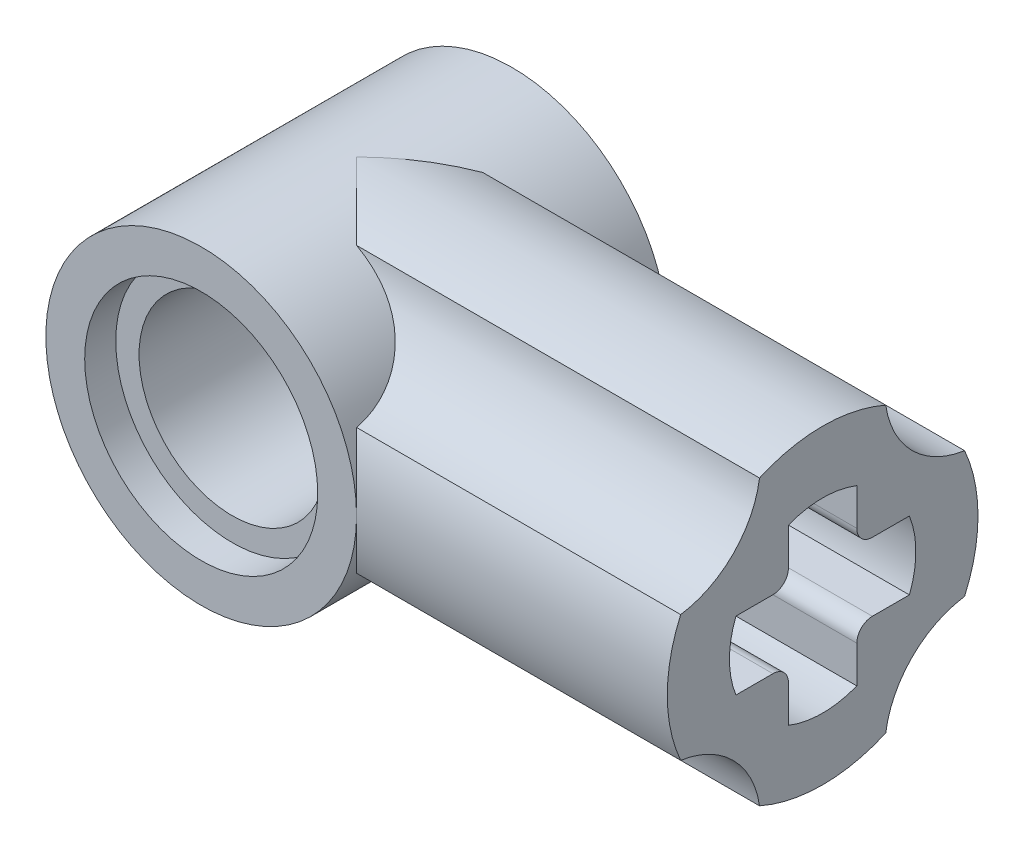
ISO-10303-21;
HEADER;
FILE_DESCRIPTION(('STEP AP214'),'2;1');
FILE_NAME('part.step','',(''),(''),'','','');
FILE_SCHEMA(('AUTOMOTIVE_DESIGN { 1 0 10303 214 1 1 1 1 }'));
ENDSEC;
DATA;
#1=APPLICATION_CONTEXT('core data for automotive mechanical design processes');
#2=APPLICATION_PROTOCOL_DEFINITION('international standard','automotive_design',2000,#1);
#3=PRODUCT_CONTEXT('',#1,'mechanical');
#4=PRODUCT('Part','Part','',(#3));
#5=PRODUCT_RELATED_PRODUCT_CATEGORY('part','',(#4));
#6=PRODUCT_DEFINITION_FORMATION('','',#4);
#7=PRODUCT_DEFINITION_CONTEXT('part definition',#1,'design');
#8=PRODUCT_DEFINITION('design','',#6,#7);
#9=PRODUCT_DEFINITION_SHAPE('','',#8);
#10=(LENGTH_UNIT() NAMED_UNIT(*) SI_UNIT(.MILLI.,.METRE.));
#11=(NAMED_UNIT(*) PLANE_ANGLE_UNIT() SI_UNIT($,.RADIAN.));
#12=(NAMED_UNIT(*) SI_UNIT($,.STERADIAN.) SOLID_ANGLE_UNIT());
#13=UNCERTAINTY_MEASURE_WITH_UNIT(LENGTH_MEASURE(1.E-05),#10,'distance_accuracy_value','');
#14=(GEOMETRIC_REPRESENTATION_CONTEXT(3) GLOBAL_UNCERTAINTY_ASSIGNED_CONTEXT((#13)) GLOBAL_UNIT_ASSIGNED_CONTEXT((#10,
#11,#12)) REPRESENTATION_CONTEXT('',''));
#15=CARTESIAN_POINT('',(0.,0.,0.));
#16=DIRECTION('',(0.,0.,1.));
#17=DIRECTION('',(1.,0.,0.));
#18=AXIS2_PLACEMENT_3D('',#15,#16,#17);
#19=CARTESIAN_POINT('',(-16.001,0.,0.));
#20=DIRECTION('',(1.,0.,0.));
#21=DIRECTION('',(0.,0.,-1.));
#22=AXIS2_PLACEMENT_3D('',#19,#20,#21);
#23=CYLINDRICAL_SURFACE('',#22,2.4);
#24=CARTESIAN_POINT('',(-8.0980005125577,-0.88,-2.23284571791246));
#25=CARTESIAN_POINT('',(-8.08565780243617,-0.825310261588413,-2.25440776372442));
#26=CARTESIAN_POINT('',(-8.07431405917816,-0.769615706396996,-2.27402849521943));
#27=CARTESIAN_POINT('',(-8.05382622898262,-0.65650653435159,-2.30922093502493));
#28=CARTESIAN_POINT('',(-8.04468434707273,-0.599090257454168,-2.32478858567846));
#29=CARTESIAN_POINT('',(-8.02888721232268,-0.483375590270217,-2.35156339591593));
#30=CARTESIAN_POINT('',(-8.02221372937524,-0.425087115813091,-2.36280254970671));
#31=CARTESIAN_POINT('',(-8.01141298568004,-0.307645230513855,-2.38094104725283));
#32=CARTESIAN_POINT('',(-8.00728368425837,-0.248492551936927,-2.38784386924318));
#33=CARTESIAN_POINT('',(-8.00298589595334,-0.157696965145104,-2.39502095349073));
#34=CARTESIAN_POINT('',(-8.00186792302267,-0.126215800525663,-2.3968859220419));
#35=CARTESIAN_POINT('',(-8.00037385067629,-0.0631604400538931,-2.39937685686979));
#36=CARTESIAN_POINT('',(-7.99999847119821,-0.0315861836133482,-2.40000162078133));
#37=CARTESIAN_POINT('',(-8.00000578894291,0.119603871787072,-2.39999386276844));
#38=CARTESIAN_POINT('',(-8.00541578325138,0.2393787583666,-2.3910064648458));
#39=CARTESIAN_POINT('',(-8.02658138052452,0.475415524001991,-2.35547319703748));
#40=CARTESIAN_POINT('',(-8.0423468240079,0.591673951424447,-2.3289106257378));
#41=CARTESIAN_POINT('',(-8.06785389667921,0.734269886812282,-2.28513120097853));
#42=CARTESIAN_POINT('',(-8.07348986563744,0.76381667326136,-2.27542319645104));
#43=CARTESIAN_POINT('',(-8.08532756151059,0.822328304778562,-2.25493486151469));
#44=CARTESIAN_POINT('',(-8.09152771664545,0.851294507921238,-2.24415750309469));
#45=CARTESIAN_POINT('',(-8.09800051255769,0.88,-2.23284571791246));
#46=B_SPLINE_CURVE_WITH_KNOTS('',3,(#24,#25,#26,#27,#28,#29,#30,#31,#32,#33,#34,#35,#36,#37,#38,
#39,#40,#41,#42,#43,#44,#45),.UNSPECIFIED.,.F.,.F.,(4,2,2,2,2,2,2,2,2,2,4),(0.,
0.180177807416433,0.360535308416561,0.539532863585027,0.718386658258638,0.813023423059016,
0.907751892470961,1.26644960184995,1.62548866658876,1.72029357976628,1.81484201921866),.UNSPECIFIED.);
#47=CARTESIAN_POINT('',(-8.09800051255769,-0.88,-2.23284571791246));
#48=VERTEX_POINT('',#47);
#49=CARTESIAN_POINT('',(-8.09800051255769,0.88,-2.23284571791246));
#50=VERTEX_POINT('',#49);
#51=EDGE_CURVE('E188',#48,#50,#46,.T.);
#52=ORIENTED_EDGE('',*,*,#51,.F.);
#53=DIRECTION('',(1.,0.,0.));
#54=VECTOR('',#53,1.);
#55=CARTESIAN_POINT('',(-16.001,-0.88,-2.23284571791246));
#56=LINE('',#55,#54);
#57=CARTESIAN_POINT('',(0.,-0.88,-2.23284571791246));
#58=VERTEX_POINT('',#57);
#59=EDGE_CURVE('E201',#48,#58,#56,.T.);
#60=ORIENTED_EDGE('',*,*,#59,.T.);
#61=CARTESIAN_POINT('',(0.,0.,0.));
#62=DIRECTION('',(1.,0.,0.));
#63=DIRECTION('',(0.,0.,-1.));
#64=AXIS2_PLACEMENT_3D('',#61,#62,#63);
#65=CIRCLE('',#64,2.4);
#66=CARTESIAN_POINT('',(0.,0.88,-2.23284571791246));
#67=VERTEX_POINT('',#66);
#68=EDGE_CURVE('E20',#67,#58,#65,.F.);
#69=ORIENTED_EDGE('',*,*,#68,.F.);
#70=DIRECTION('',(1.,0.,0.));
#71=VECTOR('',#70,1.);
#72=CARTESIAN_POINT('',(-16.001,0.88,-2.23284571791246));
#73=LINE('',#72,#71);
#74=EDGE_CURVE('E210',#67,#50,#73,.F.);
#75=ORIENTED_EDGE('',*,*,#74,.T.);
#76=EDGE_LOOP('',(#52,#60,#69,#75));
#77=FACE_BOUND('',#76,.T.);
#78=ADVANCED_FACE('F16',(#77),#23,.F.);
#79=CARTESIAN_POINT('',(-16.001,-0.88,-2.23284571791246));
#80=DIRECTION('',(0.,-1.,0.));
#81=DIRECTION('',(0.,0.,-1.));
#82=AXIS2_PLACEMENT_3D('',#79,#80,#81);
#83=PLANE('',#82);
#84=DIRECTION('',(1.,0.,0.));
#85=VECTOR('',#84,1.);
#86=CARTESIAN_POINT('',(-16.001,-0.88,-1.28));
#87=LINE('',#86,#85);
#88=CARTESIAN_POINT('',(0.,-0.88,-1.28));
#89=VERTEX_POINT('',#88);
#90=CARTESIAN_POINT('',(-8.09800051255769,-0.88,-1.28));
#91=VERTEX_POINT('',#90);
#92=EDGE_CURVE('E206',#89,#91,#87,.F.);
#93=ORIENTED_EDGE('',*,*,#92,.F.);
#94=DIRECTION('',(0.,0.,-1.));
#95=VECTOR('',#94,1.);
#96=CARTESIAN_POINT('',(0.,-0.88,-2.23284571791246));
#97=LINE('',#96,#95);
#98=EDGE_CURVE('E195',#58,#89,#97,.F.);
#99=ORIENTED_EDGE('',*,*,#98,.F.);
#100=ORIENTED_EDGE('',*,*,#59,.F.);
#101=DIRECTION('',(0.,0.,-1.));
#102=VECTOR('',#101,1.);
#103=CARTESIAN_POINT('',(-8.09800051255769,-0.88,-2.23284571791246));
#104=LINE('',#103,#102);
#105=EDGE_CURVE('E208',#91,#48,#104,.T.);
#106=ORIENTED_EDGE('',*,*,#105,.F.);
#107=EDGE_LOOP('',(#93,#99,#100,#106));
#108=FACE_BOUND('',#107,.T.);
#109=ADVANCED_FACE('F204',(#108),#83,.F.);
#110=CARTESIAN_POINT('',(-16.001,0.88,-0.88));
#111=DIRECTION('',(0.,1.,0.));
#112=DIRECTION('',(0.,0.,1.));
#113=AXIS2_PLACEMENT_3D('',#110,#111,#112);
#114=PLANE('',#113);
#115=DIRECTION('',(1.,0.,0.));
#116=VECTOR('',#115,1.);
#117=CARTESIAN_POINT('',(-16.001,0.88,-1.28));
#118=LINE('',#117,#116);
#119=CARTESIAN_POINT('',(-8.09800051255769,0.88,-1.28));
#120=VERTEX_POINT('',#119);
#121=CARTESIAN_POINT('',(0.,0.88,-1.28));
#122=VERTEX_POINT('',#121);
#123=EDGE_CURVE('E439',#120,#122,#118,.T.);
#124=ORIENTED_EDGE('',*,*,#123,.F.);
#125=DIRECTION('',(0.,0.,1.));
#126=VECTOR('',#125,1.);
#127=CARTESIAN_POINT('',(-8.09800051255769,0.88,-0.88));
#128=LINE('',#127,#126);
#129=EDGE_CURVE('E214',#50,#120,#128,.T.);
#130=ORIENTED_EDGE('',*,*,#129,.F.);
#131=ORIENTED_EDGE('',*,*,#74,.F.);
#132=DIRECTION('',(0.,0.,1.));
#133=VECTOR('',#132,1.);
#134=CARTESIAN_POINT('',(0.,0.88,-0.88));
#135=LINE('',#134,#133);
#136=EDGE_CURVE('E198',#122,#67,#135,.F.);
#137=ORIENTED_EDGE('',*,*,#136,.F.);
#138=EDGE_LOOP('',(#124,#130,#131,#137));
#139=FACE_BOUND('',#138,.T.);
#140=ADVANCED_FACE('F455',(#139),#114,.F.);
#141=CARTESIAN_POINT('',(-16.001,-1.28,-1.28));
#142=DIRECTION('',(1.,0.,0.));
#143=DIRECTION('',(0.,0.,-1.));
#144=AXIS2_PLACEMENT_3D('',#141,#142,#143);
#145=CYLINDRICAL_SURFACE('',#144,0.4);
#146=CARTESIAN_POINT('',(0.,-1.28,-1.28));
#147=DIRECTION('',(1.,0.,0.));
#148=DIRECTION('',(0.,0.,-1.));
#149=AXIS2_PLACEMENT_3D('',#146,#147,#148);
#150=CIRCLE('',#149,0.4);
#151=CARTESIAN_POINT('',(0.,-1.28,-0.88));
#152=VERTEX_POINT('',#151);
#153=EDGE_CURVE('E445',#152,#89,#150,.F.);
#154=ORIENTED_EDGE('',*,*,#153,.T.);
#155=ORIENTED_EDGE('',*,*,#92,.T.);
#156=CARTESIAN_POINT('',(-8.21032982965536,-1.28,-0.88));
#157=CARTESIAN_POINT('',(-8.20260598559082,-1.25715882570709,-0.879981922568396));
#158=CARTESIAN_POINT('',(-8.19510104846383,-1.23423188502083,-0.881956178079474));
#159=CARTESIAN_POINT('',(-8.18068221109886,-1.18884860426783,-0.889847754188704));
#160=CARTESIAN_POINT('',(-8.17376898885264,-1.16639282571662,-0.895769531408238));
#161=CARTESIAN_POINT('',(-8.16069442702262,-1.12261326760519,-0.911527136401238));
#162=CARTESIAN_POINT('',(-8.15453432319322,-1.10129138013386,-0.921369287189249));
#163=CARTESIAN_POINT('',(-8.14309758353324,-1.06054250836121,-0.944754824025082));
#164=CARTESIAN_POINT('',(-8.13782017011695,-1.04111386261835,-0.958294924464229));
#165=CARTESIAN_POINT('',(-8.1283856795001,-1.00545115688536,-0.988202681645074));
#166=CARTESIAN_POINT('',(-8.12419599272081,-0.989129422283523,-1.00445547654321));
#167=CARTESIAN_POINT('',(-8.11673767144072,-0.95943148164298,-1.03965477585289));
#168=CARTESIAN_POINT('',(-8.11346921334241,-0.9460558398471,-1.05860179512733));
#169=CARTESIAN_POINT('',(-8.10796359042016,-0.923139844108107,-1.09792576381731));
#170=CARTESIAN_POINT('',(-8.10569455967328,-0.913482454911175,-1.11823022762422));
#171=CARTESIAN_POINT('',(-8.10202480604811,-0.897694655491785,-1.16023064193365));
#172=CARTESIAN_POINT('',(-8.10062323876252,-0.891560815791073,-1.18192521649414));
#173=CARTESIAN_POINT('',(-8.09910031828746,-0.884865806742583,-1.21650060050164));
#174=CARTESIAN_POINT('',(-8.09868746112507,-0.883041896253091,-1.22913769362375));
#175=CARTESIAN_POINT('',(-8.09813795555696,-0.880609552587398,-1.2545145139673));
#176=CARTESIAN_POINT('',(-8.09800088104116,-0.879999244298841,-1.26725405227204));
#177=CARTESIAN_POINT('',(-8.0980005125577,-0.88,-1.28));
#178=B_SPLINE_CURVE_WITH_KNOTS('',3,(#156,#157,#158,#159,#160,#161,#162,#163,#164,#165,#166,
#167,#168,#169,#170,#171,#172,#173,#174,#175,#176,#177),.UNSPECIFIED.,.F.,.F.,(4,2,2,2,2,2,2,2,
2,2,4),(0.,0.0722708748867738,0.144623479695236,0.217093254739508,0.289498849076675,
0.359383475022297,0.429281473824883,0.496752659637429,0.564158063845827,0.602427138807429,
0.640637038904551),.UNSPECIFIED.);
#179=CARTESIAN_POINT('',(-8.21032982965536,-1.28,-0.88));
#180=VERTEX_POINT('',#179);
#181=EDGE_CURVE('E768',#180,#91,#178,.T.);
#182=ORIENTED_EDGE('',*,*,#181,.F.);
#183=DIRECTION('',(1.,0.,0.));
#184=VECTOR('',#183,1.);
#185=CARTESIAN_POINT('',(-16.001,-1.28,-0.88));
#186=LINE('',#185,#184);
#187=EDGE_CURVE('E477',#180,#152,#186,.T.);
#188=ORIENTED_EDGE('',*,*,#187,.T.);
#189=EDGE_LOOP('',(#154,#155,#182,#188));
#190=FACE_BOUND('',#189,.T.);
#191=ADVANCED_FACE('F727',(#190),#145,.T.);
#192=CARTESIAN_POINT('',(-16.001,-1.28,1.28));
#193=DIRECTION('',(1.,0.,0.));
#194=DIRECTION('',(0.,0.,-1.));
#195=AXIS2_PLACEMENT_3D('',#192,#193,#194);
#196=CYLINDRICAL_SURFACE('',#195,0.4);
#197=CARTESIAN_POINT('',(0.,-1.28,1.28));
#198=DIRECTION('',(1.,0.,0.));
#199=DIRECTION('',(0.,0.,-1.));
#200=AXIS2_PLACEMENT_3D('',#197,#198,#199);
#201=CIRCLE('',#200,0.4);
#202=CARTESIAN_POINT('',(0.,-0.88,1.28));
#203=VERTEX_POINT('',#202);
#204=CARTESIAN_POINT('',(0.,-1.28,0.88));
#205=VERTEX_POINT('',#204);
#206=EDGE_CURVE('E440',#203,#205,#201,.F.);
#207=ORIENTED_EDGE('',*,*,#206,.T.);
#208=DIRECTION('',(1.,0.,0.));
#209=VECTOR('',#208,1.);
#210=CARTESIAN_POINT('',(-16.001,-1.28,0.88));
#211=LINE('',#210,#209);
#212=CARTESIAN_POINT('',(-8.21032982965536,-1.28,0.88));
#213=VERTEX_POINT('',#212);
#214=EDGE_CURVE('E471',#205,#213,#211,.F.);
#215=ORIENTED_EDGE('',*,*,#214,.T.);
#216=CARTESIAN_POINT('',(-8.0980005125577,-0.88,1.28));
#217=CARTESIAN_POINT('',(-8.09800109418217,-0.879978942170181,1.25795239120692));
#218=CARTESIAN_POINT('',(-8.09841139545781,-0.881821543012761,1.23591233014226));
#219=CARTESIAN_POINT('',(-8.10005549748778,-0.88907685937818,1.19248720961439));
#220=CARTESIAN_POINT('',(-8.10128824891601,-0.89448502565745,1.17110135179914));
#221=CARTESIAN_POINT('',(-8.1045818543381,-0.908717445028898,1.12955813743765));
#222=CARTESIAN_POINT('',(-8.10664299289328,-0.917542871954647,1.10940120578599));
#223=CARTESIAN_POINT('',(-8.11159700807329,-0.938315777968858,1.07088184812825));
#224=CARTESIAN_POINT('',(-8.11448983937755,-0.950263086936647,1.0525193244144));
#225=CARTESIAN_POINT('',(-8.12112528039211,-0.976995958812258,1.01795140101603));
#226=CARTESIAN_POINT('',(-8.12487386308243,-0.991801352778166,1.00176249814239));
#227=CARTESIAN_POINT('',(-8.13318540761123,-1.02372680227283,0.97210576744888));
#228=CARTESIAN_POINT('',(-8.13774847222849,-1.04084714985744,0.958638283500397));
#229=CARTESIAN_POINT('',(-8.147753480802,-1.07729355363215,0.934457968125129));
#230=CARTESIAN_POINT('',(-8.15321310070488,-1.0966610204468,0.923814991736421));
#231=CARTESIAN_POINT('',(-8.16485376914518,-1.13670043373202,0.905906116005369));
#232=CARTESIAN_POINT('',(-8.17103494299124,-1.15737260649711,0.89864080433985));
#233=CARTESIAN_POINT('',(-8.1826587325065,-1.19507729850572,0.888738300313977));
#234=CARTESIAN_POINT('',(-8.18798978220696,-1.21197855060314,0.885454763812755));
#235=CARTESIAN_POINT('',(-8.19895104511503,-1.24593316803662,0.881085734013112));
#236=CARTESIAN_POINT('',(-8.2045806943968,-1.26298619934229,0.879996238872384));
#237=CARTESIAN_POINT('',(-8.21032982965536,-1.28,0.88));
#238=B_SPLINE_CURVE_WITH_KNOTS('',3,(#216,#217,#218,#219,#220,#221,#222,#223,#224,#225,#226,
#227,#228,#229,#230,#231,#232,#233,#234,#235,#236,#237),.UNSPECIFIED.,.F.,.F.,(4,2,2,2,2,2,2,2,
2,2,4),(0.,0.0660509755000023,0.132017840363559,0.198007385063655,0.263993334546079,
0.330454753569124,0.396924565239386,0.464910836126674,0.5329089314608,0.586846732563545,
0.640686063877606),.UNSPECIFIED.);
#239=CARTESIAN_POINT('',(-8.09800051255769,-0.88,1.28));
#240=VERTEX_POINT('',#239);
#241=EDGE_CURVE('E474',#240,#213,#238,.T.);
#242=ORIENTED_EDGE('',*,*,#241,.F.);
#243=DIRECTION('',(1.,0.,0.));
#244=VECTOR('',#243,1.);
#245=CARTESIAN_POINT('',(-16.001,-0.88,1.28));
#246=LINE('',#245,#244);
#247=EDGE_CURVE('E460',#240,#203,#246,.T.);
#248=ORIENTED_EDGE('',*,*,#247,.T.);
#249=EDGE_LOOP('',(#207,#215,#242,#248));
#250=FACE_BOUND('',#249,.T.);
#251=ADVANCED_FACE('F427',(#250),#196,.T.);
#252=CARTESIAN_POINT('',(-16.001,1.28,-1.28));
#253=DIRECTION('',(1.,0.,0.));
#254=DIRECTION('',(0.,0.,-1.));
#255=AXIS2_PLACEMENT_3D('',#252,#253,#254);
#256=CYLINDRICAL_SURFACE('',#255,0.4);
#257=CARTESIAN_POINT('',(0.,1.28,-1.28));
#258=DIRECTION('',(1.,0.,0.));
#259=DIRECTION('',(0.,0.,-1.));
#260=AXIS2_PLACEMENT_3D('',#257,#258,#259);
#261=CIRCLE('',#260,0.4);
#262=CARTESIAN_POINT('',(0.,1.28,-0.88));
#263=VERTEX_POINT('',#262);
#264=EDGE_CURVE('E441',#122,#263,#261,.F.);
#265=ORIENTED_EDGE('',*,*,#264,.T.);
#266=DIRECTION('',(1.,0.,0.));
#267=VECTOR('',#266,1.);
#268=CARTESIAN_POINT('',(-16.001,1.28,-0.88));
#269=LINE('',#268,#267);
#270=CARTESIAN_POINT('',(-8.21032982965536,1.28,-0.88));
#271=VERTEX_POINT('',#270);
#272=EDGE_CURVE('E487',#263,#271,#269,.F.);
#273=ORIENTED_EDGE('',*,*,#272,.T.);
#274=CARTESIAN_POINT('',(-8.21032982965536,1.28,-0.88));
#275=CARTESIAN_POINT('',(-8.20260598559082,1.25715882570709,-0.879981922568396));
#276=CARTESIAN_POINT('',(-8.19510104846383,1.23423188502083,-0.881956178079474));
#277=CARTESIAN_POINT('',(-8.18068221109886,1.18884860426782,-0.889847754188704));
#278=CARTESIAN_POINT('',(-8.17376898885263,1.16639282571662,-0.895769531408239));
#279=CARTESIAN_POINT('',(-8.16069442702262,1.12261326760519,-0.911527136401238));
#280=CARTESIAN_POINT('',(-8.15453432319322,1.10129138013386,-0.92136928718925));
#281=CARTESIAN_POINT('',(-8.14309758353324,1.06054250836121,-0.944754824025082));
#282=CARTESIAN_POINT('',(-8.13782017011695,1.04111386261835,-0.95829492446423));
#283=CARTESIAN_POINT('',(-8.1283856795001,1.00545115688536,-0.988202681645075));
#284=CARTESIAN_POINT('',(-8.12419599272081,0.989129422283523,-1.00445547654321));
#285=CARTESIAN_POINT('',(-8.11673767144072,0.95943148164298,-1.03965477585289));
#286=CARTESIAN_POINT('',(-8.11346921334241,0.946055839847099,-1.05860179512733));
#287=CARTESIAN_POINT('',(-8.10796359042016,0.923139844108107,-1.09792576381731));
#288=CARTESIAN_POINT('',(-8.10569455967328,0.913482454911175,-1.11823022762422));
#289=CARTESIAN_POINT('',(-8.10202480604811,0.897694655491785,-1.16023064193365));
#290=CARTESIAN_POINT('',(-8.10062323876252,0.891560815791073,-1.18192521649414));
#291=CARTESIAN_POINT('',(-8.09910031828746,0.884865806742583,-1.21650060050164));
#292=CARTESIAN_POINT('',(-8.09868746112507,0.88304189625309,-1.22913769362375));
#293=CARTESIAN_POINT('',(-8.09813795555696,0.880609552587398,-1.2545145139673));
#294=CARTESIAN_POINT('',(-8.09800088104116,0.879999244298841,-1.26725405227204));
#295=CARTESIAN_POINT('',(-8.0980005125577,0.88,-1.28));
#296=B_SPLINE_CURVE_WITH_KNOTS('',3,(#274,#275,#276,#277,#278,#279,#280,#281,#282,#283,#284,
#285,#286,#287,#288,#289,#290,#291,#292,#293,#294,#295),.UNSPECIFIED.,.F.,.F.,(4,2,2,2,2,2,2,2,
2,2,4),(0.,0.0722708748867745,0.144623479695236,0.217093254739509,0.289498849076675,
0.359383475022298,0.429281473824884,0.49675265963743,0.564158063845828,0.602427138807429,
0.640637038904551),.UNSPECIFIED.);
#297=EDGE_CURVE('E432',#271,#120,#296,.T.);
#298=ORIENTED_EDGE('',*,*,#297,.T.);
#299=ORIENTED_EDGE('',*,*,#123,.T.);
#300=EDGE_LOOP('',(#265,#273,#298,#299));
#301=FACE_BOUND('',#300,.T.);
#302=ADVANCED_FACE('F421',(#301),#256,.T.);
#303=CARTESIAN_POINT('',(-16.001,1.28,1.28));
#304=DIRECTION('',(1.,0.,0.));
#305=DIRECTION('',(0.,0.,-1.));
#306=AXIS2_PLACEMENT_3D('',#303,#304,#305);
#307=CYLINDRICAL_SURFACE('',#306,0.4);
#308=CARTESIAN_POINT('',(0.,1.28,1.28));
#309=DIRECTION('',(1.,0.,0.));
#310=DIRECTION('',(0.,0.,-1.));
#311=AXIS2_PLACEMENT_3D('',#308,#309,#310);
#312=CIRCLE('',#311,0.4);
#313=CARTESIAN_POINT('',(0.,1.28,0.88));
#314=VERTEX_POINT('',#313);
#315=CARTESIAN_POINT('',(0.,0.88,1.28));
#316=VERTEX_POINT('',#315);
#317=EDGE_CURVE('E472',#314,#316,#312,.F.);
#318=ORIENTED_EDGE('',*,*,#317,.T.);
#319=DIRECTION('',(1.,0.,0.));
#320=VECTOR('',#319,1.);
#321=CARTESIAN_POINT('',(-16.001,0.88,1.28));
#322=LINE('',#321,#320);
#323=CARTESIAN_POINT('',(-8.0980005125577,0.88,1.28));
#324=VERTEX_POINT('',#323);
#325=EDGE_CURVE('E466',#316,#324,#322,.F.);
#326=ORIENTED_EDGE('',*,*,#325,.T.);
#327=CARTESIAN_POINT('',(-8.21032982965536,1.28,0.88));
#328=CARTESIAN_POINT('',(-8.20260598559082,1.25715882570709,0.879981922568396));
#329=CARTESIAN_POINT('',(-8.19510104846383,1.23423188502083,0.881956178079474));
#330=CARTESIAN_POINT('',(-8.18068221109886,1.18884860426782,0.889847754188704));
#331=CARTESIAN_POINT('',(-8.17376898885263,1.16639282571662,0.895769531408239));
#332=CARTESIAN_POINT('',(-8.16069442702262,1.12261326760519,0.911527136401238));
#333=CARTESIAN_POINT('',(-8.15453432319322,1.10129138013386,0.92136928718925));
#334=CARTESIAN_POINT('',(-8.14309758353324,1.06054250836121,0.944754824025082));
#335=CARTESIAN_POINT('',(-8.13782017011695,1.04111386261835,0.95829492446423));
#336=CARTESIAN_POINT('',(-8.1283856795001,1.00545115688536,0.988202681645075));
#337=CARTESIAN_POINT('',(-8.12419599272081,0.989129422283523,1.00445547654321));
#338=CARTESIAN_POINT('',(-8.11673767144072,0.95943148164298,1.03965477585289));
#339=CARTESIAN_POINT('',(-8.11346921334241,0.946055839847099,1.05860179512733));
#340=CARTESIAN_POINT('',(-8.10796359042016,0.923139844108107,1.09792576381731));
#341=CARTESIAN_POINT('',(-8.10569455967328,0.913482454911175,1.11823022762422));
#342=CARTESIAN_POINT('',(-8.10202480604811,0.897694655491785,1.16023064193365));
#343=CARTESIAN_POINT('',(-8.10062323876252,0.891560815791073,1.18192521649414));
#344=CARTESIAN_POINT('',(-8.09910031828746,0.884865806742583,1.21650060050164));
#345=CARTESIAN_POINT('',(-8.09868746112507,0.88304189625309,1.22913769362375));
#346=CARTESIAN_POINT('',(-8.09813795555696,0.880609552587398,1.2545145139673));
#347=CARTESIAN_POINT('',(-8.09800088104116,0.879999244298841,1.26725405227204));
#348=CARTESIAN_POINT('',(-8.0980005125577,0.88,1.28));
#349=B_SPLINE_CURVE_WITH_KNOTS('',3,(#327,#328,#329,#330,#331,#332,#333,#334,#335,#336,#337,
#338,#339,#340,#341,#342,#343,#344,#345,#346,#347,#348),.UNSPECIFIED.,.F.,.F.,(4,2,2,2,2,2,2,2,
2,2,4),(0.,0.0722708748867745,0.144623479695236,0.217093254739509,0.289498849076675,
0.359383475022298,0.429281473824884,0.49675265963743,0.564158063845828,0.602427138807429,
0.640637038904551),.UNSPECIFIED.);
#350=CARTESIAN_POINT('',(-8.21032982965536,1.28,0.88));
#351=VERTEX_POINT('',#350);
#352=EDGE_CURVE('E406',#351,#324,#349,.T.);
#353=ORIENTED_EDGE('',*,*,#352,.F.);
#354=DIRECTION('',(1.,0.,0.));
#355=VECTOR('',#354,1.);
#356=CARTESIAN_POINT('',(-16.001,1.28,0.88));
#357=LINE('',#356,#355);
#358=EDGE_CURVE('E404',#351,#314,#357,.T.);
#359=ORIENTED_EDGE('',*,*,#358,.T.);
#360=EDGE_LOOP('',(#318,#326,#353,#359));
#361=FACE_BOUND('',#360,.T.);
#362=ADVANCED_FACE('F415',(#361),#307,.T.);
#363=CARTESIAN_POINT('',(-12.,0.,-4.));
#364=DIRECTION('',(0.,0.,1.));
#365=DIRECTION('',(1.,0.,0.));
#366=AXIS2_PLACEMENT_3D('',#363,#364,#365);
#367=CYLINDRICAL_SURFACE('',#366,2.4);
#368=CARTESIAN_POINT('',(-12.,0.,-3.2));
#369=DIRECTION('',(0.,0.,1.));
#370=DIRECTION('',(1.,0.,0.));
#371=AXIS2_PLACEMENT_3D('',#368,#369,#370);
#372=CIRCLE('',#371,2.4);
#373=CARTESIAN_POINT('',(-9.6,0.,-3.2));
#374=VERTEX_POINT('',#373);
#375=EDGE_CURVE('E397',#374,#374,#372,.T.);
#376=ORIENTED_EDGE('',*,*,#375,.F.);
#377=EDGE_LOOP('',(#376));
#378=FACE_BOUND('',#377,.T.);
#379=CARTESIAN_POINT('',(-12.,0.,3.2));
#380=DIRECTION('',(0.,0.,1.));
#381=DIRECTION('',(1.,0.,0.));
#382=AXIS2_PLACEMENT_3D('',#379,#380,#381);
#383=CIRCLE('',#382,2.4);
#384=CARTESIAN_POINT('',(-9.6,0.,3.2));
#385=VERTEX_POINT('',#384);
#386=EDGE_CURVE('E394',#385,#385,#383,.F.);
#387=ORIENTED_EDGE('',*,*,#386,.F.);
#388=EDGE_LOOP('',(#387));
#389=FACE_BOUND('',#388,.T.);
#390=ADVANCED_FACE('F420',(#378,#389),#367,.F.);
#391=CARTESIAN_POINT('',(-16.001,-0.88,0.88));
#392=DIRECTION('',(0.,0.,1.));
#393=DIRECTION('',(0.,-1.,0.));
#394=AXIS2_PLACEMENT_3D('',#391,#392,#393);
#395=PLANE('',#394);
#396=ORIENTED_EDGE('',*,*,#214,.F.);
#397=DIRECTION('',(0.,-1.,0.));
#398=VECTOR('',#397,1.);
#399=CARTESIAN_POINT('',(0.,-0.88,0.88));
#400=LINE('',#399,#398);
#401=CARTESIAN_POINT('',(0.,-2.23284571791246,0.88));
#402=VERTEX_POINT('',#401);
#403=EDGE_CURVE('E469',#402,#205,#400,.F.);
#404=ORIENTED_EDGE('',*,*,#403,.F.);
#405=DIRECTION('',(1.,0.,0.));
#406=VECTOR('',#405,1.);
#407=CARTESIAN_POINT('',(-16.001,-2.23284571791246,0.88));
#408=LINE('',#407,#406);
#409=CARTESIAN_POINT('',(-8.68120503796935,-2.23284571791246,0.88));
#410=VERTEX_POINT('',#409);
#411=EDGE_CURVE('E393',#402,#410,#408,.F.);
#412=ORIENTED_EDGE('',*,*,#411,.T.);
#413=CARTESIAN_POINT('',(-12.,0.,0.88));
#414=DIRECTION('',(0.,0.,1.));
#415=DIRECTION('',(1.,0.,0.));
#416=AXIS2_PLACEMENT_3D('',#413,#414,#415);
#417=CIRCLE('',#416,4.);
#418=EDGE_CURVE('E773',#213,#410,#417,.F.);
#419=ORIENTED_EDGE('',*,*,#418,.F.);
#420=EDGE_LOOP('',(#396,#404,#412,#419));
#421=FACE_BOUND('',#420,.T.);
#422=ADVANCED_FACE('F689',(#421),#395,.F.);
#423=CARTESIAN_POINT('',(-16.001,-0.88,-0.88));
#424=DIRECTION('',(0.,0.,-1.));
#425=DIRECTION('',(0.,1.,0.));
#426=AXIS2_PLACEMENT_3D('',#423,#424,#425);
#427=PLANE('',#426);
#428=ORIENTED_EDGE('',*,*,#187,.F.);
#429=CARTESIAN_POINT('',(-12.,0.,-0.879999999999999));
#430=DIRECTION('',(0.,0.,1.));
#431=DIRECTION('',(1.,0.,0.));
#432=AXIS2_PLACEMENT_3D('',#429,#430,#431);
#433=CIRCLE('',#432,4.);
#434=CARTESIAN_POINT('',(-8.68120503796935,-2.23284571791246,-0.879999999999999));
#435=VERTEX_POINT('',#434);
#436=EDGE_CURVE('E480',#435,#180,#433,.T.);
#437=ORIENTED_EDGE('',*,*,#436,.F.);
#438=DIRECTION('',(1.,0.,0.));
#439=VECTOR('',#438,1.);
#440=CARTESIAN_POINT('',(-16.001,-2.23284571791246,-0.879999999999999));
#441=LINE('',#440,#439);
#442=CARTESIAN_POINT('',(0.,-2.23284571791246,-0.88));
#443=VERTEX_POINT('',#442);
#444=EDGE_CURVE('E392',#435,#443,#441,.T.);
#445=ORIENTED_EDGE('',*,*,#444,.T.);
#446=DIRECTION('',(0.,1.,0.));
#447=VECTOR('',#446,1.);
#448=CARTESIAN_POINT('',(0.,-0.88,-0.88));
#449=LINE('',#448,#447);
#450=EDGE_CURVE('E475',#152,#443,#449,.F.);
#451=ORIENTED_EDGE('',*,*,#450,.F.);
#452=EDGE_LOOP('',(#428,#437,#445,#451));
#453=FACE_BOUND('',#452,.T.);
#454=ADVANCED_FACE('F679',(#453),#427,.F.);
#455=CARTESIAN_POINT('',(-16.001,0.88,2.23284571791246));
#456=DIRECTION('',(0.,1.,0.));
#457=DIRECTION('',(0.,0.,1.));
#458=AXIS2_PLACEMENT_3D('',#455,#456,#457);
#459=PLANE('',#458);
#460=ORIENTED_EDGE('',*,*,#325,.F.);
#461=DIRECTION('',(0.,0.,1.));
#462=VECTOR('',#461,1.);
#463=CARTESIAN_POINT('',(0.,0.88,2.23284571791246));
#464=LINE('',#463,#462);
#465=CARTESIAN_POINT('',(0.,0.88,2.23284571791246));
#466=VERTEX_POINT('',#465);
#467=EDGE_CURVE('E468',#466,#316,#464,.F.);
#468=ORIENTED_EDGE('',*,*,#467,.F.);
#469=DIRECTION('',(1.,0.,0.));
#470=VECTOR('',#469,1.);
#471=CARTESIAN_POINT('',(-16.001,0.88,2.23284571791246));
#472=LINE('',#471,#470);
#473=CARTESIAN_POINT('',(-8.0980005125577,0.88,2.23284571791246));
#474=VERTEX_POINT('',#473);
#475=EDGE_CURVE('E497',#466,#474,#472,.F.);
#476=ORIENTED_EDGE('',*,*,#475,.T.);
#477=DIRECTION('',(0.,0.,1.));
#478=VECTOR('',#477,1.);
#479=CARTESIAN_POINT('',(-8.0980005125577,0.88,-4.));
#480=LINE('',#479,#478);
#481=EDGE_CURVE('E405',#324,#474,#480,.T.);
#482=ORIENTED_EDGE('',*,*,#481,.F.);
#483=EDGE_LOOP('',(#460,#468,#476,#482));
#484=FACE_BOUND('',#483,.T.);
#485=ADVANCED_FACE('F669',(#484),#459,.F.);
#486=CARTESIAN_POINT('',(-16.001,-0.88,0.88));
#487=DIRECTION('',(0.,-1.,0.));
#488=DIRECTION('',(0.,0.,-1.));
#489=AXIS2_PLACEMENT_3D('',#486,#487,#488);
#490=PLANE('',#489);
#491=ORIENTED_EDGE('',*,*,#247,.F.);
#492=DIRECTION('',(0.,0.,-1.));
#493=VECTOR('',#492,1.);
#494=CARTESIAN_POINT('',(-8.09800051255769,-0.88,0.88));
#495=LINE('',#494,#493);
#496=CARTESIAN_POINT('',(-8.09800051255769,-0.88,2.23284571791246));
#497=VERTEX_POINT('',#496);
#498=EDGE_CURVE('E464',#497,#240,#495,.T.);
#499=ORIENTED_EDGE('',*,*,#498,.F.);
#500=DIRECTION('',(1.,0.,0.));
#501=VECTOR('',#500,1.);
#502=CARTESIAN_POINT('',(-16.001,-0.879999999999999,2.23284571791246));
#503=LINE('',#502,#501);
#504=CARTESIAN_POINT('',(0.,-0.879999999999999,2.23284571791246));
#505=VERTEX_POINT('',#504);
#506=EDGE_CURVE('E499',#497,#505,#503,.T.);
#507=ORIENTED_EDGE('',*,*,#506,.T.);
#508=DIRECTION('',(0.,0.,-1.));
#509=VECTOR('',#508,1.);
#510=CARTESIAN_POINT('',(0.,-0.88,0.88));
#511=LINE('',#510,#509);
#512=EDGE_CURVE('E463',#203,#505,#511,.F.);
#513=ORIENTED_EDGE('',*,*,#512,.F.);
#514=EDGE_LOOP('',(#491,#499,#507,#513));
#515=FACE_BOUND('',#514,.T.);
#516=ADVANCED_FACE('F660',(#515),#490,.F.);
#517=CARTESIAN_POINT('',(-16.001,2.23284571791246,-0.88));
#518=DIRECTION('',(0.,0.,-1.));
#519=DIRECTION('',(0.,1.,0.));
#520=AXIS2_PLACEMENT_3D('',#517,#518,#519);
#521=PLANE('',#520);
#522=ORIENTED_EDGE('',*,*,#272,.F.);
#523=DIRECTION('',(0.,1.,0.));
#524=VECTOR('',#523,1.);
#525=CARTESIAN_POINT('',(0.,2.23284571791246,-0.88));
#526=LINE('',#525,#524);
#527=CARTESIAN_POINT('',(0.,2.23284571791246,-0.88));
#528=VERTEX_POINT('',#527);
#529=EDGE_CURVE('E483',#528,#263,#526,.F.);
#530=ORIENTED_EDGE('',*,*,#529,.F.);
#531=DIRECTION('',(1.,0.,0.));
#532=VECTOR('',#531,1.);
#533=CARTESIAN_POINT('',(-16.001,2.23284571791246,-0.88));
#534=LINE('',#533,#532);
#535=CARTESIAN_POINT('',(-8.68120503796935,2.23284571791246,-0.88));
#536=VERTEX_POINT('',#535);
#537=EDGE_CURVE('E360',#528,#536,#534,.F.);
#538=ORIENTED_EDGE('',*,*,#537,.T.);
#539=CARTESIAN_POINT('',(-12.,0.,-0.88));
#540=DIRECTION('',(0.,0.,1.));
#541=DIRECTION('',(1.,0.,0.));
#542=AXIS2_PLACEMENT_3D('',#539,#540,#541);
#543=CIRCLE('',#542,4.);
#544=EDGE_CURVE('E413',#271,#536,#543,.T.);
#545=ORIENTED_EDGE('',*,*,#544,.F.);
#546=EDGE_LOOP('',(#522,#530,#538,#545));
#547=FACE_BOUND('',#546,.T.);
#548=ADVANCED_FACE('F652',(#547),#521,.F.);
#549=CARTESIAN_POINT('',(-12.,0.,-4.));
#550=DIRECTION('',(0.,0.,1.));
#551=DIRECTION('',(1.,0.,0.));
#552=AXIS2_PLACEMENT_3D('',#549,#550,#551);
#553=CYLINDRICAL_SURFACE('',#552,4.);
#554=ORIENTED_EDGE('',*,*,#481,.T.);
#555=CARTESIAN_POINT('',(-8.0980005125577,0.88,2.23284571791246));
#556=CARTESIAN_POINT('',(-8.08565780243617,0.825310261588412,2.25440776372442));
#557=CARTESIAN_POINT('',(-8.07431405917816,0.769615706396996,2.27402849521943));
#558=CARTESIAN_POINT('',(-8.05382622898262,0.656506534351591,2.30922093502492));
#559=CARTESIAN_POINT('',(-8.04468434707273,0.599090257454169,2.32478858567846));
#560=CARTESIAN_POINT('',(-8.02888721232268,0.483375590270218,2.35156339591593));
#561=CARTESIAN_POINT('',(-8.02221372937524,0.425087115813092,2.36280254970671));
#562=CARTESIAN_POINT('',(-8.01141298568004,0.307645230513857,2.38094104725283));
#563=CARTESIAN_POINT('',(-8.00728368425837,0.24849255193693,2.38784386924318));
#564=CARTESIAN_POINT('',(-8.00298589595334,0.157696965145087,2.39502095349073));
#565=CARTESIAN_POINT('',(-8.00186792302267,0.126215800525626,2.3968859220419));
#566=CARTESIAN_POINT('',(-8.00037385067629,0.0631604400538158,2.39937685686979));
#567=CARTESIAN_POINT('',(-7.99999847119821,0.0315861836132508,2.40000162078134));
#568=CARTESIAN_POINT('',(-8.00000578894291,-0.11960387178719,2.39999386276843));
#569=CARTESIAN_POINT('',(-8.00541578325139,-0.239378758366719,2.39100646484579));
#570=CARTESIAN_POINT('',(-8.02658138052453,-0.475415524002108,2.35547319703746));
#571=CARTESIAN_POINT('',(-8.04234682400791,-0.591673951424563,2.32891062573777));
#572=CARTESIAN_POINT('',(-8.06785389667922,-0.734269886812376,2.2851312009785));
#573=CARTESIAN_POINT('',(-8.07348986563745,-0.763816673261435,2.27542319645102));
#574=CARTESIAN_POINT('',(-8.08532756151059,-0.822328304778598,2.25493486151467));
#575=CARTESIAN_POINT('',(-8.09152771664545,-0.851294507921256,2.24415750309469));
#576=CARTESIAN_POINT('',(-8.09800051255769,-0.88,2.23284571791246));
#577=B_SPLINE_CURVE_WITH_KNOTS('',3,(#555,#556,#557,#558,#559,#560,#561,#562,#563,#564,#565,
#566,#567,#568,#569,#570,#571,#572,#573,#574,#575,#576),.UNSPECIFIED.,.F.,.F.,(4,2,2,2,2,2,2,2,
2,2,4),(0.,0.180177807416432,0.360535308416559,0.539532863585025,0.718386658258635,
0.813023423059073,0.907751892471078,1.26644960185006,1.62548866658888,1.72029357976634,
1.81484201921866),.UNSPECIFIED.);
#578=EDGE_CURVE('E361',#474,#497,#577,.T.);
#579=ORIENTED_EDGE('',*,*,#578,.T.);
#580=ORIENTED_EDGE('',*,*,#498,.T.);
#581=ORIENTED_EDGE('',*,*,#241,.T.);
#582=ORIENTED_EDGE('',*,*,#418,.T.);
#583=CARTESIAN_POINT('',(-8.68120503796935,-2.23284571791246,0.88));
#584=CARTESIAN_POINT('',(-8.69482831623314,-2.25309234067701,0.828620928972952));
#585=CARTESIAN_POINT('',(-8.70757605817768,-2.27164319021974,0.776354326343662));
#586=CARTESIAN_POINT('',(-8.73098263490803,-2.30519938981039,0.670197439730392));
#587=CARTESIAN_POINT('',(-8.74163990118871,-2.32020207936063,0.616305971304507));
#588=CARTESIAN_POINT('',(-8.76988650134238,-2.3595410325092,0.452845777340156));
#589=CARTESIAN_POINT('',(-8.78383107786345,-2.37832380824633,0.341200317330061));
#590=CARTESIAN_POINT('',(-8.79993135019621,-2.3999494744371,0.114984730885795));
#591=CARTESIAN_POINT('',(-8.80202875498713,-2.40271355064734,0.000402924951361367));
#592=CARTESIAN_POINT('',(-8.79394278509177,-2.39191046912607,-0.227516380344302));
#593=CARTESIAN_POINT('',(-8.78376511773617,-2.37835090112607,-0.340854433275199));
#594=CARTESIAN_POINT('',(-8.75793359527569,-2.34292434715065,-0.525726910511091));
#595=CARTESIAN_POINT('',(-8.74524960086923,-2.32535237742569,-0.598565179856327));
#596=CARTESIAN_POINT('',(-8.7159654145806,-2.28380057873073,-0.741475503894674));
#597=CARTESIAN_POINT('',(-8.69937059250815,-2.25982953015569,-0.811551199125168));
#598=CARTESIAN_POINT('',(-8.68120503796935,-2.23284571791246,-0.879999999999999));
#599=B_SPLINE_CURVE_WITH_KNOTS('',3,(#583,#584,#585,#586,#587,#588,#589,#590,#591,#592,#593,
#594,#595,#596,#597,#598),.UNSPECIFIED.,.F.,.F.,(4,2,2,2,2,2,2,4),(0.,0.170568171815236,
0.341263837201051,0.681696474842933,1.02380267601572,1.36574987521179,1.59333538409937,
1.82061020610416),.UNSPECIFIED.);
#600=EDGE_CURVE('E387',#410,#435,#599,.T.);
#601=ORIENTED_EDGE('',*,*,#600,.T.);
#602=ORIENTED_EDGE('',*,*,#436,.T.);
#603=ORIENTED_EDGE('',*,*,#181,.T.);
#604=ORIENTED_EDGE('',*,*,#105,.T.);
#605=ORIENTED_EDGE('',*,*,#51,.T.);
#606=ORIENTED_EDGE('',*,*,#129,.T.);
#607=ORIENTED_EDGE('',*,*,#297,.F.);
#608=ORIENTED_EDGE('',*,*,#544,.T.);
#609=CARTESIAN_POINT('',(-8.68120503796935,2.23284571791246,-0.88));
#610=CARTESIAN_POINT('',(-8.69482831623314,2.25309234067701,-0.828620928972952));
#611=CARTESIAN_POINT('',(-8.70757605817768,2.27164319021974,-0.776354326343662));
#612=CARTESIAN_POINT('',(-8.73098263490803,2.30519938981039,-0.670197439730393));
#613=CARTESIAN_POINT('',(-8.74163990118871,2.32020207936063,-0.616305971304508));
#614=CARTESIAN_POINT('',(-8.76988650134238,2.3595410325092,-0.452845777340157));
#615=CARTESIAN_POINT('',(-8.78383107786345,2.37832380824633,-0.341200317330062));
#616=CARTESIAN_POINT('',(-8.79993135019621,2.3999494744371,-0.114984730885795));
#617=CARTESIAN_POINT('',(-8.80202875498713,2.40271355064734,-0.000402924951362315));
#618=CARTESIAN_POINT('',(-8.79394278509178,2.39191046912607,0.227516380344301));
#619=CARTESIAN_POINT('',(-8.78376511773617,2.37835090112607,0.340854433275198));
#620=CARTESIAN_POINT('',(-8.7579335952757,2.34292434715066,0.52572691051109));
#621=CARTESIAN_POINT('',(-8.74524960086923,2.32535237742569,0.598565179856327));
#622=CARTESIAN_POINT('',(-8.7159654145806,2.28380057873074,0.741475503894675));
#623=CARTESIAN_POINT('',(-8.69937059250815,2.25982953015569,0.81155119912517));
#624=CARTESIAN_POINT('',(-8.68120503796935,2.23284571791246,0.88));
#625=B_SPLINE_CURVE_WITH_KNOTS('',3,(#609,#610,#611,#612,#613,#614,#615,#616,#617,#618,#619,
#620,#621,#622,#623,#624),.UNSPECIFIED.,.F.,.F.,(4,2,2,2,2,2,2,4),(0.,0.170568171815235,
0.34126383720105,0.681696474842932,1.02380267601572,1.36574987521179,1.59333538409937,
1.82061020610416),.UNSPECIFIED.);
#626=CARTESIAN_POINT('',(-8.68120503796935,2.23284571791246,0.880000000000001));
#627=VERTEX_POINT('',#626);
#628=EDGE_CURVE('E354',#536,#627,#625,.T.);
#629=ORIENTED_EDGE('',*,*,#628,.T.);
#630=CARTESIAN_POINT('',(-12.,0.,0.880000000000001));
#631=DIRECTION('',(0.,0.,1.));
#632=DIRECTION('',(1.,0.,0.));
#633=AXIS2_PLACEMENT_3D('',#630,#631,#632);
#634=CIRCLE('',#633,4.);
#635=EDGE_CURVE('E401',#627,#351,#634,.F.);
#636=ORIENTED_EDGE('',*,*,#635,.T.);
#637=ORIENTED_EDGE('',*,*,#352,.T.);
#638=EDGE_LOOP('',(#554,#579,#580,#581,#582,#601,#602,#603,#604,#605,#606,#607,#608,#629,#636,#637));
#639=FACE_BOUND('',#638,.T.);
#640=ADVANCED_FACE('F367',(#639),#553,.T.);
#641=CARTESIAN_POINT('',(-16.001,2.23284571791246,0.88));
#642=DIRECTION('',(0.,0.,1.));
#643=DIRECTION('',(0.,-1.,0.));
#644=AXIS2_PLACEMENT_3D('',#641,#642,#643);
#645=PLANE('',#644);
#646=ORIENTED_EDGE('',*,*,#358,.F.);
#647=ORIENTED_EDGE('',*,*,#635,.F.);
#648=DIRECTION('',(1.,0.,0.));
#649=VECTOR('',#648,1.);
#650=CARTESIAN_POINT('',(-16.001,2.23284571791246,0.88));
#651=LINE('',#650,#649);
#652=CARTESIAN_POINT('',(0.,2.23284571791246,0.88));
#653=VERTEX_POINT('',#652);
#654=EDGE_CURVE('E353',#627,#653,#651,.T.);
#655=ORIENTED_EDGE('',*,*,#654,.T.);
#656=DIRECTION('',(0.,-1.,0.));
#657=VECTOR('',#656,1.);
#658=CARTESIAN_POINT('',(0.,2.23284571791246,0.88));
#659=LINE('',#658,#657);
#660=EDGE_CURVE('E400',#314,#653,#659,.F.);
#661=ORIENTED_EDGE('',*,*,#660,.F.);
#662=EDGE_LOOP('',(#646,#647,#655,#661));
#663=FACE_BOUND('',#662,.T.);
#664=ADVANCED_FACE('F544',(#663),#645,.F.);
#665=CARTESIAN_POINT('',(-12.,0.,-3.2));
#666=DIRECTION('',(0.,0.,-1.));
#667=DIRECTION('',(-1.,0.,0.));
#668=AXIS2_PLACEMENT_3D('',#665,#666,#667);
#669=PLANE('',#668);
#670=ORIENTED_EDGE('',*,*,#375,.T.);
#671=EDGE_LOOP('',(#670));
#672=FACE_BOUND('',#671,.T.);
#673=CARTESIAN_POINT('',(-12.,0.,-3.2));
#674=DIRECTION('',(0.,0.,-1.));
#675=DIRECTION('',(-1.,0.,0.));
#676=AXIS2_PLACEMENT_3D('',#673,#674,#675);
#677=CIRCLE('',#676,3.);
#678=CARTESIAN_POINT('',(-15.,0.,-3.2));
#679=VERTEX_POINT('',#678);
#680=EDGE_CURVE('E350',#679,#679,#677,.T.);
#681=ORIENTED_EDGE('',*,*,#680,.T.);
#682=EDGE_LOOP('',(#681));
#683=FACE_BOUND('',#682,.T.);
#684=ADVANCED_FACE('F542',(#672,#683),#669,.T.);
#685=CARTESIAN_POINT('',(-12.,0.,3.2));
#686=DIRECTION('',(0.,0.,1.));
#687=DIRECTION('',(1.,0.,0.));
#688=AXIS2_PLACEMENT_3D('',#685,#686,#687);
#689=PLANE('',#688);
#690=ORIENTED_EDGE('',*,*,#386,.T.);
#691=EDGE_LOOP('',(#690));
#692=FACE_BOUND('',#691,.T.);
#693=CARTESIAN_POINT('',(-12.,0.,3.2));
#694=DIRECTION('',(0.,0.,1.));
#695=DIRECTION('',(1.,0.,0.));
#696=AXIS2_PLACEMENT_3D('',#693,#694,#695);
#697=CIRCLE('',#696,3.);
#698=CARTESIAN_POINT('',(-9.,0.,3.2));
#699=VERTEX_POINT('',#698);
#700=EDGE_CURVE('E346',#699,#699,#697,.T.);
#701=ORIENTED_EDGE('',*,*,#700,.T.);
#702=EDGE_LOOP('',(#701));
#703=FACE_BOUND('',#702,.T.);
#704=ADVANCED_FACE('F384',(#692,#703),#689,.T.);
#705=CARTESIAN_POINT('',(-16.001,0.,0.));
#706=DIRECTION('',(1.,0.,0.));
#707=DIRECTION('',(0.,0.,-1.));
#708=AXIS2_PLACEMENT_3D('',#705,#706,#707);
#709=CYLINDRICAL_SURFACE('',#708,2.4);
#710=ORIENTED_EDGE('',*,*,#600,.F.);
#711=ORIENTED_EDGE('',*,*,#411,.F.);
#712=CARTESIAN_POINT('',(0.,0.,0.));
#713=DIRECTION('',(1.,0.,0.));
#714=DIRECTION('',(0.,0.,-1.));
#715=AXIS2_PLACEMENT_3D('',#712,#713,#714);
#716=CIRCLE('',#715,2.4);
#717=EDGE_CURVE('E342',#443,#402,#716,.F.);
#718=ORIENTED_EDGE('',*,*,#717,.F.);
#719=ORIENTED_EDGE('',*,*,#444,.F.);
#720=EDGE_LOOP('',(#710,#711,#718,#719));
#721=FACE_BOUND('',#720,.T.);
#722=ADVANCED_FACE('F379',(#721),#709,.F.);
#723=CARTESIAN_POINT('',(-16.001,0.,0.));
#724=DIRECTION('',(1.,0.,0.));
#725=DIRECTION('',(0.,0.,-1.));
#726=AXIS2_PLACEMENT_3D('',#723,#724,#725);
#727=CYLINDRICAL_SURFACE('',#726,2.4);
#728=ORIENTED_EDGE('',*,*,#506,.F.);
#729=ORIENTED_EDGE('',*,*,#578,.F.);
#730=ORIENTED_EDGE('',*,*,#475,.F.);
#731=CARTESIAN_POINT('',(0.,0.,0.));
#732=DIRECTION('',(1.,0.,0.));
#733=DIRECTION('',(0.,0.,-1.));
#734=AXIS2_PLACEMENT_3D('',#731,#732,#733);
#735=CIRCLE('',#734,2.4);
#736=EDGE_CURVE('E339',#505,#466,#735,.F.);
#737=ORIENTED_EDGE('',*,*,#736,.F.);
#738=EDGE_LOOP('',(#728,#729,#730,#737));
#739=FACE_BOUND('',#738,.T.);
#740=ADVANCED_FACE('F374',(#739),#727,.F.);
#741=CARTESIAN_POINT('',(-16.001,0.,0.));
#742=DIRECTION('',(1.,0.,0.));
#743=DIRECTION('',(0.,0.,-1.));
#744=AXIS2_PLACEMENT_3D('',#741,#742,#743);
#745=CYLINDRICAL_SURFACE('',#744,2.4);
#746=ORIENTED_EDGE('',*,*,#628,.F.);
#747=ORIENTED_EDGE('',*,*,#537,.F.);
#748=CARTESIAN_POINT('',(0.,0.,0.));
#749=DIRECTION('',(1.,0.,0.));
#750=DIRECTION('',(0.,0.,-1.));
#751=AXIS2_PLACEMENT_3D('',#748,#749,#750);
#752=CIRCLE('',#751,2.4);
#753=EDGE_CURVE('E336',#653,#528,#752,.F.);
#754=ORIENTED_EDGE('',*,*,#753,.F.);
#755=ORIENTED_EDGE('',*,*,#654,.F.);
#756=EDGE_LOOP('',(#746,#747,#754,#755));
#757=FACE_BOUND('',#756,.T.);
#758=ADVANCED_FACE('F371',(#757),#745,.F.);
#759=CARTESIAN_POINT('',(-12.,0.,-3.2));
#760=DIRECTION('',(0.,0.,-1.));
#761=DIRECTION('',(-1.,0.,0.));
#762=AXIS2_PLACEMENT_3D('',#759,#760,#761);
#763=CYLINDRICAL_SURFACE('',#762,3.);
#764=CARTESIAN_POINT('',(-12.,0.,-4.));
#765=DIRECTION('',(0.,0.,-1.));
#766=DIRECTION('',(-1.,0.,0.));
#767=AXIS2_PLACEMENT_3D('',#764,#765,#766);
#768=CIRCLE('',#767,3.);
#769=CARTESIAN_POINT('',(-15.,0.,-4.));
#770=VERTEX_POINT('',#769);
#771=EDGE_CURVE('E321',#770,#770,#768,.T.);
#772=ORIENTED_EDGE('',*,*,#771,.T.);
#773=EDGE_LOOP('',(#772));
#774=FACE_BOUND('',#773,.T.);
#775=ORIENTED_EDGE('',*,*,#680,.F.);
#776=EDGE_LOOP('',(#775));
#777=FACE_BOUND('',#776,.T.);
#778=ADVANCED_FACE('F307',(#774,#777),#763,.F.);
#779=CARTESIAN_POINT('',(-16.001,-4.,-4.));
#780=DIRECTION('',(1.,0.,0.));
#781=DIRECTION('',(0.,0.,-1.));
#782=AXIS2_PLACEMENT_3D('',#779,#780,#781);
#783=CYLINDRICAL_SURFACE('',#782,2.4);
#784=DIRECTION('',(1.,0.,0.));
#785=VECTOR('',#784,1.);
#786=CARTESIAN_POINT('',(-16.001,-1.62491379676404,-3.65508620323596));
#787=LINE('',#786,#785);
#788=CARTESIAN_POINT('',(0.,-1.62491379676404,-3.65508620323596));
#789=VERTEX_POINT('',#788);
#790=CARTESIAN_POINT('',(-8.34491379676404,-1.62491379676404,-3.65508620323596));
#791=VERTEX_POINT('',#790);
#792=EDGE_CURVE('E324',#789,#791,#787,.F.);
#793=ORIENTED_EDGE('',*,*,#792,.F.);
#794=CARTESIAN_POINT('',(0.,-4.,-4.));
#795=DIRECTION('',(1.,0.,0.));
#796=DIRECTION('',(0.,0.,-1.));
#797=AXIS2_PLACEMENT_3D('',#794,#795,#796);
#798=CIRCLE('',#797,2.4);
#799=CARTESIAN_POINT('',(0.,-3.65508620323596,-1.62491379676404));
#800=VERTEX_POINT('',#799);
#801=EDGE_CURVE('E328',#800,#789,#798,.F.);
#802=ORIENTED_EDGE('',*,*,#801,.F.);
#803=DIRECTION('',(1.,0.,0.));
#804=VECTOR('',#803,1.);
#805=CARTESIAN_POINT('',(-16.001,-3.65508620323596,-1.62491379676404));
#806=LINE('',#805,#804);
#807=CARTESIAN_POINT('',(-10.375086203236,-3.65508620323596,-1.62491379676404));
#808=VERTEX_POINT('',#807);
#809=EDGE_CURVE('E349',#808,#800,#806,.T.);
#810=ORIENTED_EDGE('',*,*,#809,.F.);
#811=CARTESIAN_POINT('',(-8.34491379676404,-1.62491379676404,-3.65508620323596));
#812=CARTESIAN_POINT('',(-8.3488076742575,-1.63365001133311,-3.59486576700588));
#813=CARTESIAN_POINT('',(-8.35374090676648,-1.64468450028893,-3.53504696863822));
#814=CARTESIAN_POINT('',(-8.36580861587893,-1.67119258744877,-3.41662458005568));
#815=CARTESIAN_POINT('',(-8.37294319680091,-1.68666639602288,-3.35802104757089));
#816=CARTESIAN_POINT('',(-8.38953041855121,-1.72188341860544,-3.24248433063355));
#817=CARTESIAN_POINT('',(-8.39898155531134,-1.74162386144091,-3.18555008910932));
#818=CARTESIAN_POINT('',(-8.42034957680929,-1.78513025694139,-3.07373991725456));
#819=CARTESIAN_POINT('',(-8.4322663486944,-1.80889602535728,-3.0188638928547));
#820=CARTESIAN_POINT('',(-8.4720037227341,-1.88589257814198,-2.85777764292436));
#821=CARTESIAN_POINT('',(-8.50380523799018,-1.94480861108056,-2.75515449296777));
#822=CARTESIAN_POINT('',(-8.57916850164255,-2.07448831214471,-2.56268164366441));
#823=CARTESIAN_POINT('',(-8.62272229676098,-2.14524395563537,-2.47282336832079));
#824=CARTESIAN_POINT('',(-8.72181458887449,-2.29376630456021,-2.30858168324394));
#825=CARTESIAN_POINT('',(-8.7772230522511,-2.37145199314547,-2.2340463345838));
#826=CARTESIAN_POINT('',(-8.90015898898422,-2.53002759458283,-2.10000614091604));
#827=CARTESIAN_POINT('',(-8.96768565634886,-2.61091729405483,-2.0405002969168));
#828=CARTESIAN_POINT('',(-9.11744135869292,-2.77557544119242,-1.93338471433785));
#829=CARTESIAN_POINT('',(-9.20021716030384,-2.85929767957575,-1.88647591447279));
#830=CARTESIAN_POINT('',(-9.37668242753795,-3.02202717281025,-1.80641185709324));
#831=CARTESIAN_POINT('',(-9.47039743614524,-3.10102271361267,-1.77328964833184));
#832=CARTESIAN_POINT('',(-9.63000037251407,-3.22321618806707,-1.72863096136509));
#833=CARTESIAN_POINT('',(-9.69319824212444,-3.26875895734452,-1.71365358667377));
#834=CARTESIAN_POINT('',(-9.82271881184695,-3.35642029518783,-1.68744785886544));
#835=CARTESIAN_POINT('',(-9.88904285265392,-3.39853737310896,-1.67622113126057));
#836=CARTESIAN_POINT('',(-10.024041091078,-3.47875259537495,-1.65692530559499));
#837=CARTESIAN_POINT('',(-10.0927016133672,-3.51687009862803,-1.64884043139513));
#838=CARTESIAN_POINT('',(-10.2322762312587,-3.58905785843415,-1.63516177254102));
#839=CARTESIAN_POINT('',(-10.3031880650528,-3.62313202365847,-1.62956556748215));
#840=CARTESIAN_POINT('',(-10.375086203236,-3.65508620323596,-1.62491379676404));
#841=B_SPLINE_CURVE_WITH_KNOTS('',3,(#811,#812,#813,#814,#815,#816,#817,#818,#819,#820,#821,
#822,#823,#824,#825,#826,#827,#828,#829,#830,#831,#832,#833,#834,#835,#836,#837,#838,#839,#840),
.UNSPECIFIED.,.F.,.F.,(4,2,2,2,2,2,2,2,2,2,2,2,2,2,4),(0.,0.182870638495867,0.365749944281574,
0.548510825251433,0.731263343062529,1.09690984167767,1.4623095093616,1.82388969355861,
2.18544583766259,2.56420913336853,2.9438752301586,3.18164590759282,3.41951950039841,
3.65618273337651,3.89261528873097),.UNSPECIFIED.);
#842=EDGE_CURVE('E311',#791,#808,#841,.T.);
#843=ORIENTED_EDGE('',*,*,#842,.F.);
#844=EDGE_LOOP('',(#793,#802,#810,#843));
#845=FACE_BOUND('',#844,.T.);
#846=ADVANCED_FACE('F302',(#845),#783,.F.);
#847=CARTESIAN_POINT('',(-16.001,0.,0.));
#848=DIRECTION('',(1.,0.,0.));
#849=DIRECTION('',(0.,0.,-1.));
#850=AXIS2_PLACEMENT_3D('',#847,#848,#849);
#851=CYLINDRICAL_SURFACE('',#850,4.);
#852=DIRECTION('',(1.,0.,0.));
#853=VECTOR('',#852,1.);
#854=CARTESIAN_POINT('',(-16.001,-3.65508620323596,1.62491379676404));
#855=LINE('',#854,#853);
#856=CARTESIAN_POINT('',(0.,-3.65508620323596,1.62491379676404));
#857=VERTEX_POINT('',#856);
#858=CARTESIAN_POINT('',(-10.375086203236,-3.65508620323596,1.62491379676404));
#859=VERTEX_POINT('',#858);
#860=EDGE_CURVE('E345',#857,#859,#855,.F.);
#861=ORIENTED_EDGE('',*,*,#860,.T.);
#862=CARTESIAN_POINT('',(-12.,0.,0.));
#863=DIRECTION('',(-0.707106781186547,0.,0.707106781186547));
#864=DIRECTION('',(0.707106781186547,0.,0.707106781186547));
#865=AXIS2_PLACEMENT_3D('',#862,#863,#864);
#866=ELLIPSE('',#865,5.65685424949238,4.);
#867=CARTESIAN_POINT('',(-12.,-4.,0.));
#868=VERTEX_POINT('',#867);
#869=EDGE_CURVE('E286',#868,#859,#866,.T.);
#870=ORIENTED_EDGE('',*,*,#869,.F.);
#871=CARTESIAN_POINT('',(-12.,0.,0.));
#872=DIRECTION('',(0.707106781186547,0.,0.707106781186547));
#873=DIRECTION('',(0.707106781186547,0.,-0.707106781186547));
#874=AXIS2_PLACEMENT_3D('',#871,#872,#873);
#875=ELLIPSE('',#874,5.65685424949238,4.);
#876=EDGE_CURVE('E317',#808,#868,#875,.F.);
#877=ORIENTED_EDGE('',*,*,#876,.F.);
#878=ORIENTED_EDGE('',*,*,#809,.T.);
#879=CARTESIAN_POINT('',(0.,0.,0.));
#880=DIRECTION('',(1.,0.,0.));
#881=DIRECTION('',(0.,0.,-1.));
#882=AXIS2_PLACEMENT_3D('',#879,#880,#881);
#883=CIRCLE('',#882,4.);
#884=EDGE_CURVE('E330',#857,#800,#883,.T.);
#885=ORIENTED_EDGE('',*,*,#884,.F.);
#886=EDGE_LOOP('',(#861,#870,#877,#878,#885));
#887=FACE_BOUND('',#886,.T.);
#888=ADVANCED_FACE('F298',(#887),#851,.T.);
#889=CARTESIAN_POINT('',(-12.,0.,3.2));
#890=DIRECTION('',(0.,0.,1.));
#891=DIRECTION('',(1.,0.,0.));
#892=AXIS2_PLACEMENT_3D('',#889,#890,#891);
#893=CYLINDRICAL_SURFACE('',#892,3.);
#894=CARTESIAN_POINT('',(-12.,0.,4.));
#895=DIRECTION('',(0.,0.,1.));
#896=DIRECTION('',(1.,0.,0.));
#897=AXIS2_PLACEMENT_3D('',#894,#895,#896);
#898=CIRCLE('',#897,3.);
#899=CARTESIAN_POINT('',(-9.,0.,4.));
#900=VERTEX_POINT('',#899);
#901=EDGE_CURVE('E277',#900,#900,#898,.F.);
#902=ORIENTED_EDGE('',*,*,#901,.F.);
#903=EDGE_LOOP('',(#902));
#904=FACE_BOUND('',#903,.T.);
#905=ORIENTED_EDGE('',*,*,#700,.F.);
#906=EDGE_LOOP('',(#905));
#907=FACE_BOUND('',#906,.T.);
#908=ADVANCED_FACE('F293',(#904,#907),#893,.F.);
#909=CARTESIAN_POINT('',(-16.001,-4.,4.));
#910=DIRECTION('',(1.,0.,0.));
#911=DIRECTION('',(0.,0.,-1.));
#912=AXIS2_PLACEMENT_3D('',#909,#910,#911);
#913=CYLINDRICAL_SURFACE('',#912,2.4);
#914=ORIENTED_EDGE('',*,*,#860,.F.);
#915=CARTESIAN_POINT('',(0.,-4.,4.));
#916=DIRECTION('',(1.,0.,0.));
#917=DIRECTION('',(0.,0.,-1.));
#918=AXIS2_PLACEMENT_3D('',#915,#916,#917);
#919=CIRCLE('',#918,2.4);
#920=CARTESIAN_POINT('',(0.,-1.62491379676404,3.65508620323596));
#921=VERTEX_POINT('',#920);
#922=EDGE_CURVE('E333',#921,#857,#919,.F.);
#923=ORIENTED_EDGE('',*,*,#922,.F.);
#924=DIRECTION('',(1.,0.,0.));
#925=VECTOR('',#924,1.);
#926=CARTESIAN_POINT('',(-16.001,-1.62491379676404,3.65508620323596));
#927=LINE('',#926,#925);
#928=CARTESIAN_POINT('',(-8.34491379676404,-1.62491379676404,3.65508620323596));
#929=VERTEX_POINT('',#928);
#930=EDGE_CURVE('E273',#929,#921,#927,.T.);
#931=ORIENTED_EDGE('',*,*,#930,.F.);
#932=CARTESIAN_POINT('',(-10.375086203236,-3.65508620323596,1.62491379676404));
#933=CARTESIAN_POINT('',(-10.2823139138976,-3.61387188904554,1.63092923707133));
#934=CARTESIAN_POINT('',(-10.1911709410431,-3.56909577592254,1.6384992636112));
#935=CARTESIAN_POINT('',(-10.0126857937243,-3.47287100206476,1.65807936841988));
#936=CARTESIAN_POINT('',(-9.92535378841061,-3.4214057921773,1.67010060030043));
#937=CARTESIAN_POINT('',(-9.7549201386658,-3.31209012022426,1.70000011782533));
#938=CARTESIAN_POINT('',(-9.67185200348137,-3.25419788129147,1.71791841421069));
#939=CARTESIAN_POINT('',(-9.51161777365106,-3.13337103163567,1.76101246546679));
#940=CARTESIAN_POINT('',(-9.43444436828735,-3.07044287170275,1.78617903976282));
#941=CARTESIAN_POINT('',(-9.26343126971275,-2.92025141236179,1.85455544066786));
#942=CARTESIAN_POINT('',(-9.17204364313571,-2.83158792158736,1.90095472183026));
#943=CARTESIAN_POINT('',(-9.00335038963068,-2.65238561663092,2.01130610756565));
#944=CARTESIAN_POINT('',(-8.92598770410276,-2.56185614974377,2.07518430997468));
#945=CARTESIAN_POINT('',(-8.82101407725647,-2.42844107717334,2.18517706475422));
#946=CARTESIAN_POINT('',(-8.78775386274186,-2.38418821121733,2.22439555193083));
#947=CARTESIAN_POINT('',(-8.72509637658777,-2.29735939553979,2.30748194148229));
#948=CARTESIAN_POINT('',(-8.69569745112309,-2.2547827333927,2.3513478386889));
#949=CARTESIAN_POINT('',(-8.64070585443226,-2.17200832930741,2.44362830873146));
#950=CARTESIAN_POINT('',(-8.6151186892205,-2.13181407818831,2.49204929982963));
#951=CARTESIAN_POINT('',(-8.56770483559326,-2.05460502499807,2.5930577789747));
#952=CARTESIAN_POINT('',(-8.54587776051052,-2.01758989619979,2.64564483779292));
#953=CARTESIAN_POINT('',(-8.48962965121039,-1.91902233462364,2.79865941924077));
#954=CARTESIAN_POINT('',(-8.45926306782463,-1.86177889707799,2.9034421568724));
#955=CARTESIAN_POINT('',(-8.40905565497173,-1.76301379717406,3.12233368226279));
#956=CARTESIAN_POINT('',(-8.38920111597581,-1.72147167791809,3.23643009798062));
#957=CARTESIAN_POINT('',(-8.36751785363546,-1.67490117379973,3.40287021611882));
#958=CARTESIAN_POINT('',(-8.36190160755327,-1.6626424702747,3.4528132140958));
#959=CARTESIAN_POINT('',(-8.35224853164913,-1.64135387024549,3.55343145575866));
#960=CARTESIAN_POINT('',(-8.34820866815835,-1.63231777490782,3.60410509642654));
#961=CARTESIAN_POINT('',(-8.34491379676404,-1.62491379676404,3.65508620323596));
#962=B_SPLINE_CURVE_WITH_KNOTS('',3,(#932,#933,#934,#935,#936,#937,#938,#939,#940,#941,#942,
#943,#944,#945,#946,#947,#948,#949,#950,#951,#952,#953,#954,#955,#956,#957,#958,#959,#960,#961),
.UNSPECIFIED.,.F.,.F.,(4,2,2,2,2,2,2,2,2,2,2,2,2,2,4),(0.,0.305068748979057,0.610907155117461,
0.918864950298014,1.22643439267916,1.63131432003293,2.03450815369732,2.23779057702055,
2.44098564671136,2.64447143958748,2.84793629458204,3.21562348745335,3.58282996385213,
3.73791688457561,3.89270385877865),.UNSPECIFIED.);
#963=EDGE_CURVE('E280',#859,#929,#962,.T.);
#964=ORIENTED_EDGE('',*,*,#963,.F.);
#965=EDGE_LOOP('',(#914,#923,#931,#964));
#966=FACE_BOUND('',#965,.T.);
#967=ADVANCED_FACE('F288',(#966),#913,.F.);
#968=CARTESIAN_POINT('',(0.,2.,-2.));
#969=DIRECTION('',(1.,0.,0.));
#970=DIRECTION('',(0.,0.,-1.));
#971=AXIS2_PLACEMENT_3D('',#968,#969,#970);
#972=PLANE('',#971);
#973=ORIENTED_EDGE('',*,*,#884,.T.);
#974=ORIENTED_EDGE('',*,*,#801,.T.);
#975=CARTESIAN_POINT('',(0.,0.,0.));
#976=DIRECTION('',(1.,0.,0.));
#977=DIRECTION('',(0.,0.,-1.));
#978=AXIS2_PLACEMENT_3D('',#975,#976,#977);
#979=CIRCLE('',#978,4.);
#980=CARTESIAN_POINT('',(0.,1.62491379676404,-3.65508620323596));
#981=VERTEX_POINT('',#980);
#982=EDGE_CURVE('E325',#981,#789,#979,.F.);
#983=ORIENTED_EDGE('',*,*,#982,.F.);
#984=CARTESIAN_POINT('',(0.,4.,-4.));
#985=DIRECTION('',(1.,0.,0.));
#986=DIRECTION('',(0.,0.,-1.));
#987=AXIS2_PLACEMENT_3D('',#984,#985,#986);
#988=CIRCLE('',#987,2.4);
#989=CARTESIAN_POINT('',(0.,3.65508620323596,-1.62491379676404));
#990=VERTEX_POINT('',#989);
#991=EDGE_CURVE('E260',#981,#990,#988,.F.);
#992=ORIENTED_EDGE('',*,*,#991,.T.);
#993=CARTESIAN_POINT('',(0.,0.,0.));
#994=DIRECTION('',(1.,0.,0.));
#995=DIRECTION('',(0.,0.,-1.));
#996=AXIS2_PLACEMENT_3D('',#993,#994,#995);
#997=CIRCLE('',#996,4.);
#998=CARTESIAN_POINT('',(0.,3.65508620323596,1.62491379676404));
#999=VERTEX_POINT('',#998);
#1000=EDGE_CURVE('E263',#999,#990,#997,.F.);
#1001=ORIENTED_EDGE('',*,*,#1000,.F.);
#1002=CARTESIAN_POINT('',(0.,4.,4.));
#1003=DIRECTION('',(1.,0.,0.));
#1004=DIRECTION('',(0.,0.,-1.));
#1005=AXIS2_PLACEMENT_3D('',#1002,#1003,#1004);
#1006=CIRCLE('',#1005,2.4);
#1007=CARTESIAN_POINT('',(0.,1.62491379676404,3.65508620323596));
#1008=VERTEX_POINT('',#1007);
#1009=EDGE_CURVE('E267',#999,#1008,#1006,.F.);
#1010=ORIENTED_EDGE('',*,*,#1009,.T.);
#1011=CARTESIAN_POINT('',(0.,0.,0.));
#1012=DIRECTION('',(1.,0.,0.));
#1013=DIRECTION('',(0.,0.,-1.));
#1014=AXIS2_PLACEMENT_3D('',#1011,#1012,#1013);
#1015=CIRCLE('',#1014,4.);
#1016=EDGE_CURVE('E270',#921,#1008,#1015,.F.);
#1017=ORIENTED_EDGE('',*,*,#1016,.F.);
#1018=ORIENTED_EDGE('',*,*,#922,.T.);
#1019=EDGE_LOOP('',(#973,#974,#983,#992,#1001,#1010,#1017,#1018));
#1020=FACE_BOUND('',#1019,.T.);
#1021=ORIENTED_EDGE('',*,*,#660,.T.);
#1022=ORIENTED_EDGE('',*,*,#753,.T.);
#1023=ORIENTED_EDGE('',*,*,#529,.T.);
#1024=ORIENTED_EDGE('',*,*,#264,.F.);
#1025=ORIENTED_EDGE('',*,*,#136,.T.);
#1026=ORIENTED_EDGE('',*,*,#68,.T.);
#1027=ORIENTED_EDGE('',*,*,#98,.T.);
#1028=ORIENTED_EDGE('',*,*,#153,.F.);
#1029=ORIENTED_EDGE('',*,*,#450,.T.);
#1030=ORIENTED_EDGE('',*,*,#717,.T.);
#1031=ORIENTED_EDGE('',*,*,#403,.T.);
#1032=ORIENTED_EDGE('',*,*,#206,.F.);
#1033=ORIENTED_EDGE('',*,*,#512,.T.);
#1034=ORIENTED_EDGE('',*,*,#736,.T.);
#1035=ORIENTED_EDGE('',*,*,#467,.T.);
#1036=ORIENTED_EDGE('',*,*,#317,.F.);
#1037=EDGE_LOOP('',(#1021,#1022,#1023,#1024,#1025,#1026,#1027,#1028,#1029,#1030,#1031,#1032,
#1033,#1034,#1035,#1036));
#1038=FACE_BOUND('',#1037,.T.);
#1039=ADVANCED_FACE('F193',(#1020,#1038),#972,.T.);
#1040=CARTESIAN_POINT('',(-12.,0.,-4.));
#1041=DIRECTION('',(0.,0.,1.));
#1042=DIRECTION('',(1.,0.,0.));
#1043=AXIS2_PLACEMENT_3D('',#1040,#1041,#1042);
#1044=PLANE('',#1043);
#1045=CARTESIAN_POINT('',(-12.,0.,-4.));
#1046=DIRECTION('',(0.,0.,1.));
#1047=DIRECTION('',(1.,0.,0.));
#1048=AXIS2_PLACEMENT_3D('',#1045,#1046,#1047);
#1049=CIRCLE('',#1048,4.);
#1050=CARTESIAN_POINT('',(-8.,0.,-4.));
#1051=VERTEX_POINT('',#1050);
#1052=EDGE_CURVE('E258',#1051,#1051,#1049,.T.);
#1053=ORIENTED_EDGE('',*,*,#1052,.F.);
#1054=EDGE_LOOP('',(#1053));
#1055=FACE_BOUND('',#1054,.T.);
#1056=ORIENTED_EDGE('',*,*,#771,.F.);
#1057=EDGE_LOOP('',(#1056));
#1058=FACE_BOUND('',#1057,.T.);
#1059=ADVANCED_FACE('F532',(#1055,#1058),#1044,.F.);
#1060=CARTESIAN_POINT('',(-12.,0.,4.));
#1061=DIRECTION('',(0.,0.,1.));
#1062=DIRECTION('',(1.,0.,0.));
#1063=AXIS2_PLACEMENT_3D('',#1060,#1061,#1062);
#1064=PLANE('',#1063);
#1065=CARTESIAN_POINT('',(-12.,0.,4.));
#1066=DIRECTION('',(0.,0.,1.));
#1067=DIRECTION('',(1.,0.,0.));
#1068=AXIS2_PLACEMENT_3D('',#1065,#1066,#1067);
#1069=CIRCLE('',#1068,4.);
#1070=CARTESIAN_POINT('',(-8.,0.,4.));
#1071=VERTEX_POINT('',#1070);
#1072=EDGE_CURVE('E255',#1071,#1071,#1069,.F.);
#1073=ORIENTED_EDGE('',*,*,#1072,.F.);
#1074=EDGE_LOOP('',(#1073));
#1075=FACE_BOUND('',#1074,.T.);
#1076=ORIENTED_EDGE('',*,*,#901,.T.);
#1077=EDGE_LOOP('',(#1076));
#1078=FACE_BOUND('',#1077,.T.);
#1079=ADVANCED_FACE('F535',(#1075,#1078),#1064,.T.);
#1080=CARTESIAN_POINT('',(-16.001,0.,0.));
#1081=DIRECTION('',(1.,0.,0.));
#1082=DIRECTION('',(0.,0.,-1.));
#1083=AXIS2_PLACEMENT_3D('',#1080,#1081,#1082);
#1084=CYLINDRICAL_SURFACE('',#1083,4.);
#1085=DIRECTION('',(1.,0.,0.));
#1086=VECTOR('',#1085,1.);
#1087=CARTESIAN_POINT('',(-16.001,1.62491379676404,3.65508620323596));
#1088=LINE('',#1087,#1086);
#1089=CARTESIAN_POINT('',(-8.34491379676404,1.62491379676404,3.65508620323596));
#1090=VERTEX_POINT('',#1089);
#1091=EDGE_CURVE('E269',#1008,#1090,#1088,.F.);
#1092=ORIENTED_EDGE('',*,*,#1091,.T.);
#1093=CARTESIAN_POINT('',(-12.,0.,0.));
#1094=DIRECTION('',(0.707106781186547,0.,-0.707106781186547));
#1095=DIRECTION('',(0.707106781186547,0.,0.707106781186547));
#1096=AXIS2_PLACEMENT_3D('',#1093,#1094,#1095);
#1097=ELLIPSE('',#1096,5.65685424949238,4.);
#1098=EDGE_CURVE('E252',#1071,#1090,#1097,.F.);
#1099=ORIENTED_EDGE('',*,*,#1098,.F.);
#1100=CARTESIAN_POINT('',(-12.,0.,0.));
#1101=DIRECTION('',(-0.707106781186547,0.,0.707106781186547));
#1102=DIRECTION('',(0.707106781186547,0.,0.707106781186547));
#1103=AXIS2_PLACEMENT_3D('',#1100,#1101,#1102);
#1104=ELLIPSE('',#1103,5.65685424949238,4.);
#1105=EDGE_CURVE('E274',#1071,#929,#1104,.F.);
#1106=ORIENTED_EDGE('',*,*,#1105,.T.);
#1107=ORIENTED_EDGE('',*,*,#930,.T.);
#1108=ORIENTED_EDGE('',*,*,#1016,.T.);
#1109=EDGE_LOOP('',(#1092,#1099,#1106,#1107,#1108));
#1110=FACE_BOUND('',#1109,.T.);
#1111=ADVANCED_FACE('F241',(#1110),#1084,.T.);
#1112=CARTESIAN_POINT('',(-16.001,4.,4.));
#1113=DIRECTION('',(1.,0.,0.));
#1114=DIRECTION('',(0.,0.,-1.));
#1115=AXIS2_PLACEMENT_3D('',#1112,#1113,#1114);
#1116=CYLINDRICAL_SURFACE('',#1115,2.4);
#1117=ORIENTED_EDGE('',*,*,#1091,.F.);
#1118=ORIENTED_EDGE('',*,*,#1009,.F.);
#1119=DIRECTION('',(1.,0.,0.));
#1120=VECTOR('',#1119,1.);
#1121=CARTESIAN_POINT('',(-16.001,3.65508620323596,1.62491379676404));
#1122=LINE('',#1121,#1120);
#1123=CARTESIAN_POINT('',(-10.375086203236,3.65508620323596,1.62491379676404));
#1124=VERTEX_POINT('',#1123);
#1125=EDGE_CURVE('E266',#1124,#999,#1122,.T.);
#1126=ORIENTED_EDGE('',*,*,#1125,.F.);
#1127=CARTESIAN_POINT('',(-8.34491379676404,1.62491379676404,3.65508620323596));
#1128=CARTESIAN_POINT('',(-8.3488076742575,1.63365001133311,3.59486576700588));
#1129=CARTESIAN_POINT('',(-8.35374090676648,1.64468450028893,3.53504696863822));
#1130=CARTESIAN_POINT('',(-8.36580861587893,1.67119258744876,3.41662458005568));
#1131=CARTESIAN_POINT('',(-8.37294319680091,1.68666639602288,3.35802104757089));
#1132=CARTESIAN_POINT('',(-8.38953041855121,1.72188341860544,3.24248433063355));
#1133=CARTESIAN_POINT('',(-8.39898155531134,1.74162386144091,3.18555008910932));
#1134=CARTESIAN_POINT('',(-8.42034957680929,1.78513025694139,3.07373991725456));
#1135=CARTESIAN_POINT('',(-8.4322663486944,1.80889602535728,3.0188638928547));
#1136=CARTESIAN_POINT('',(-8.4720037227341,1.88589257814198,2.85777764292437));
#1137=CARTESIAN_POINT('',(-8.50380523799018,1.94480861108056,2.75515449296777));
#1138=CARTESIAN_POINT('',(-8.57916850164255,2.07448831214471,2.56268164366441));
#1139=CARTESIAN_POINT('',(-8.62272229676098,2.14524395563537,2.47282336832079));
#1140=CARTESIAN_POINT('',(-8.72181458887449,2.29376630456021,2.30858168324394));
#1141=CARTESIAN_POINT('',(-8.7772230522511,2.37145199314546,2.2340463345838));
#1142=CARTESIAN_POINT('',(-8.90015898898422,2.53002759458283,2.10000614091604));
#1143=CARTESIAN_POINT('',(-8.96768565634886,2.61091729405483,2.0405002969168));
#1144=CARTESIAN_POINT('',(-9.11744135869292,2.77557544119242,1.93338471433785));
#1145=CARTESIAN_POINT('',(-9.20021716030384,2.85929767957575,1.88647591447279));
#1146=CARTESIAN_POINT('',(-9.37668242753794,3.02202717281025,1.80641185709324));
#1147=CARTESIAN_POINT('',(-9.47039743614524,3.10102271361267,1.77328964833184));
#1148=CARTESIAN_POINT('',(-9.63000037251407,3.22321618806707,1.72863096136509));
#1149=CARTESIAN_POINT('',(-9.69319824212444,3.26875895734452,1.71365358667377));
#1150=CARTESIAN_POINT('',(-9.82271881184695,3.35642029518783,1.68744785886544));
#1151=CARTESIAN_POINT('',(-9.88904285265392,3.39853737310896,1.67622113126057));
#1152=CARTESIAN_POINT('',(-10.024041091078,3.47875259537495,1.65692530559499));
#1153=CARTESIAN_POINT('',(-10.0927016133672,3.51687009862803,1.64884043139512));
#1154=CARTESIAN_POINT('',(-10.2322762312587,3.58905785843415,1.63516177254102));
#1155=CARTESIAN_POINT('',(-10.3031880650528,3.62313202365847,1.62956556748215));
#1156=CARTESIAN_POINT('',(-10.375086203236,3.65508620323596,1.62491379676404));
#1157=B_SPLINE_CURVE_WITH_KNOTS('',3,(#1127,#1128,#1129,#1130,#1131,#1132,#1133,#1134,#1135,
#1136,#1137,#1138,#1139,#1140,#1141,#1142,#1143,#1144,#1145,#1146,#1147,#1148,#1149,#1150,#1151,
#1152,#1153,#1154,#1155,#1156),.UNSPECIFIED.,.F.,.F.,(4,2,2,2,2,2,2,2,2,2,2,2,2,2,4),(0.,
0.182870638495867,0.365749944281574,0.548510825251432,0.73126334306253,1.09690984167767,
1.4623095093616,1.82388969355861,2.18544583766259,2.56420913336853,2.9438752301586,
3.18164590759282,3.41951950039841,3.65618273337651,3.89261528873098),.UNSPECIFIED.);
#1158=EDGE_CURVE('E245',#1090,#1124,#1157,.T.);
#1159=ORIENTED_EDGE('',*,*,#1158,.F.);
#1160=EDGE_LOOP('',(#1117,#1118,#1126,#1159));
#1161=FACE_BOUND('',#1160,.T.);
#1162=ADVANCED_FACE('F236',(#1161),#1116,.F.);
#1163=CARTESIAN_POINT('',(-16.001,0.,0.));
#1164=DIRECTION('',(1.,0.,0.));
#1165=DIRECTION('',(0.,0.,-1.));
#1166=AXIS2_PLACEMENT_3D('',#1163,#1164,#1165);
#1167=CYLINDRICAL_SURFACE('',#1166,4.);
#1168=ORIENTED_EDGE('',*,*,#1000,.T.);
#1169=DIRECTION('',(1.,0.,0.));
#1170=VECTOR('',#1169,1.);
#1171=CARTESIAN_POINT('',(-16.001,3.65508620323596,-1.62491379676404));
#1172=LINE('',#1171,#1170);
#1173=CARTESIAN_POINT('',(-10.375086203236,3.65508620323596,-1.62491379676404));
#1174=VERTEX_POINT('',#1173);
#1175=EDGE_CURVE('E262',#990,#1174,#1172,.F.);
#1176=ORIENTED_EDGE('',*,*,#1175,.T.);
#1177=CARTESIAN_POINT('',(-12.,0.,0.));
#1178=DIRECTION('',(0.707106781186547,0.,0.707106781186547));
#1179=DIRECTION('',(-0.707106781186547,0.,0.707106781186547));
#1180=AXIS2_PLACEMENT_3D('',#1177,#1178,#1179);
#1181=ELLIPSE('',#1180,5.65685424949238,4.);
#1182=CARTESIAN_POINT('',(-12.,4.,0.));
#1183=VERTEX_POINT('',#1182);
#1184=EDGE_CURVE('E223',#1183,#1174,#1181,.F.);
#1185=ORIENTED_EDGE('',*,*,#1184,.F.);
#1186=CARTESIAN_POINT('',(-12.,0.,0.));
#1187=DIRECTION('',(0.707106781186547,0.,-0.707106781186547));
#1188=DIRECTION('',(0.707106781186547,0.,0.707106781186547));
#1189=AXIS2_PLACEMENT_3D('',#1186,#1187,#1188);
#1190=ELLIPSE('',#1189,5.65685424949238,4.);
#1191=EDGE_CURVE('E251',#1124,#1183,#1190,.F.);
#1192=ORIENTED_EDGE('',*,*,#1191,.F.);
#1193=ORIENTED_EDGE('',*,*,#1125,.T.);
#1194=EDGE_LOOP('',(#1168,#1176,#1185,#1192,#1193));
#1195=FACE_BOUND('',#1194,.T.);
#1196=ADVANCED_FACE('F233',(#1195),#1167,.T.);
#1197=CARTESIAN_POINT('',(-16.001,4.,-4.));
#1198=DIRECTION('',(1.,0.,0.));
#1199=DIRECTION('',(0.,0.,-1.));
#1200=AXIS2_PLACEMENT_3D('',#1197,#1198,#1199);
#1201=CYLINDRICAL_SURFACE('',#1200,2.4);
#1202=ORIENTED_EDGE('',*,*,#1175,.F.);
#1203=ORIENTED_EDGE('',*,*,#991,.F.);
#1204=DIRECTION('',(1.,0.,0.));
#1205=VECTOR('',#1204,1.);
#1206=CARTESIAN_POINT('',(-16.001,1.62491379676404,-3.65508620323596));
#1207=LINE('',#1206,#1205);
#1208=CARTESIAN_POINT('',(-8.34491379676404,1.62491379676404,-3.65508620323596));
#1209=VERTEX_POINT('',#1208);
#1210=EDGE_CURVE('E35',#1209,#981,#1207,.T.);
#1211=ORIENTED_EDGE('',*,*,#1210,.F.);
#1212=CARTESIAN_POINT('',(-10.375086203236,3.65508620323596,-1.62491379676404));
#1213=CARTESIAN_POINT('',(-10.2823139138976,3.61387188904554,-1.63092923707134));
#1214=CARTESIAN_POINT('',(-10.1911709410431,3.56909577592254,-1.63849926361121));
#1215=CARTESIAN_POINT('',(-10.0126857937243,3.47287100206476,-1.65807936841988));
#1216=CARTESIAN_POINT('',(-9.92535378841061,3.4214057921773,-1.67010060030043));
#1217=CARTESIAN_POINT('',(-9.7549201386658,3.31209012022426,-1.70000011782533));
#1218=CARTESIAN_POINT('',(-9.67185200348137,3.25419788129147,-1.71791841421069));
#1219=CARTESIAN_POINT('',(-9.51161777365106,3.13337103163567,-1.76101246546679));
#1220=CARTESIAN_POINT('',(-9.43444436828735,3.07044287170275,-1.78617903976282));
#1221=CARTESIAN_POINT('',(-9.26343126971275,2.92025141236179,-1.85455544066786));
#1222=CARTESIAN_POINT('',(-9.17204364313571,2.83158792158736,-1.90095472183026));
#1223=CARTESIAN_POINT('',(-9.00335038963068,2.65238561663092,-2.01130610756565));
#1224=CARTESIAN_POINT('',(-8.92598770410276,2.56185614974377,-2.07518430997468));
#1225=CARTESIAN_POINT('',(-8.82101407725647,2.42844107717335,-2.18517706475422));
#1226=CARTESIAN_POINT('',(-8.78775386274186,2.38418821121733,-2.22439555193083));
#1227=CARTESIAN_POINT('',(-8.72509637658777,2.29735939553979,-2.30748194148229));
#1228=CARTESIAN_POINT('',(-8.6956974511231,2.2547827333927,-2.3513478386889));
#1229=CARTESIAN_POINT('',(-8.64070585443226,2.17200832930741,-2.44362830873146));
#1230=CARTESIAN_POINT('',(-8.6151186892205,2.13181407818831,-2.49204929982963));
#1231=CARTESIAN_POINT('',(-8.56770483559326,2.05460502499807,-2.5930577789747));
#1232=CARTESIAN_POINT('',(-8.54587776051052,2.01758989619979,-2.64564483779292));
#1233=CARTESIAN_POINT('',(-8.48962965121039,1.91902233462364,-2.79865941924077));
#1234=CARTESIAN_POINT('',(-8.45926306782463,1.86177889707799,-2.9034421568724));
#1235=CARTESIAN_POINT('',(-8.40905565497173,1.76301379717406,-3.12233368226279));
#1236=CARTESIAN_POINT('',(-8.38920111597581,1.72147167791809,-3.23643009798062));
#1237=CARTESIAN_POINT('',(-8.36751785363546,1.67490117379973,-3.40287021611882));
#1238=CARTESIAN_POINT('',(-8.36190160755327,1.6626424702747,-3.4528132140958));
#1239=CARTESIAN_POINT('',(-8.35224853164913,1.6413538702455,-3.55343145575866));
#1240=CARTESIAN_POINT('',(-8.34820866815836,1.63231777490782,-3.60410509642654));
#1241=CARTESIAN_POINT('',(-8.34491379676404,1.62491379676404,-3.65508620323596));
#1242=B_SPLINE_CURVE_WITH_KNOTS('',3,(#1212,#1213,#1214,#1215,#1216,#1217,#1218,#1219,#1220,
#1221,#1222,#1223,#1224,#1225,#1226,#1227,#1228,#1229,#1230,#1231,#1232,#1233,#1234,#1235,#1236,
#1237,#1238,#1239,#1240,#1241),.UNSPECIFIED.,.F.,.F.,(4,2,2,2,2,2,2,2,2,2,2,2,2,2,4),(0.,
0.305068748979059,0.610907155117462,0.918864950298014,1.22643439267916,1.63131432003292,
2.03450815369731,2.23779057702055,2.44098564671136,2.64447143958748,2.84793629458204,
3.21562348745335,3.58282996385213,3.73791688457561,3.89270385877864),.UNSPECIFIED.);
#1243=EDGE_CURVE('E26',#1174,#1209,#1242,.T.);
#1244=ORIENTED_EDGE('',*,*,#1243,.F.);
#1245=EDGE_LOOP('',(#1202,#1203,#1211,#1244));
#1246=FACE_BOUND('',#1245,.T.);
#1247=ADVANCED_FACE('F228',(#1246),#1201,.F.);
#1248=CARTESIAN_POINT('',(-16.001,0.,0.));
#1249=DIRECTION('',(1.,0.,0.));
#1250=DIRECTION('',(0.,0.,-1.));
#1251=AXIS2_PLACEMENT_3D('',#1248,#1249,#1250);
#1252=CYLINDRICAL_SURFACE('',#1251,4.);
#1253=ORIENTED_EDGE('',*,*,#1210,.T.);
#1254=ORIENTED_EDGE('',*,*,#982,.T.);
#1255=ORIENTED_EDGE('',*,*,#792,.T.);
#1256=CARTESIAN_POINT('',(-12.,0.,0.));
#1257=DIRECTION('',(0.707106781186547,0.,0.707106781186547));
#1258=DIRECTION('',(0.707106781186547,0.,-0.707106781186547));
#1259=AXIS2_PLACEMENT_3D('',#1256,#1257,#1258);
#1260=ELLIPSE('',#1259,5.65685424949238,4.);
#1261=EDGE_CURVE('E318',#1051,#791,#1260,.F.);
#1262=ORIENTED_EDGE('',*,*,#1261,.F.);
#1263=CARTESIAN_POINT('',(-12.,0.,0.));
#1264=DIRECTION('',(0.707106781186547,0.,0.707106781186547));
#1265=DIRECTION('',(0.707106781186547,0.,-0.707106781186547));
#1266=AXIS2_PLACEMENT_3D('',#1263,#1264,#1265);
#1267=ELLIPSE('',#1266,5.65685424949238,4.);
#1268=EDGE_CURVE('E9',#1209,#1051,#1267,.F.);
#1269=ORIENTED_EDGE('',*,*,#1268,.F.);
#1270=EDGE_LOOP('',(#1253,#1254,#1255,#1262,#1269));
#1271=FACE_BOUND('',#1270,.T.);
#1272=ADVANCED_FACE('F232',(#1271),#1252,.T.);
#1273=CARTESIAN_POINT('',(-12.,0.,-4.));
#1274=DIRECTION('',(0.,0.,1.));
#1275=DIRECTION('',(1.,0.,0.));
#1276=AXIS2_PLACEMENT_3D('',#1273,#1274,#1275);
#1277=CYLINDRICAL_SURFACE('',#1276,4.);
#1278=ORIENTED_EDGE('',*,*,#1243,.T.);
#1279=ORIENTED_EDGE('',*,*,#1268,.T.);
#1280=ORIENTED_EDGE('',*,*,#1052,.T.);
#1281=ORIENTED_EDGE('',*,*,#1261,.T.);
#1282=ORIENTED_EDGE('',*,*,#842,.T.);
#1283=ORIENTED_EDGE('',*,*,#876,.T.);
#1284=ORIENTED_EDGE('',*,*,#869,.T.);
#1285=ORIENTED_EDGE('',*,*,#963,.T.);
#1286=ORIENTED_EDGE('',*,*,#1105,.F.);
#1287=ORIENTED_EDGE('',*,*,#1072,.T.);
#1288=ORIENTED_EDGE('',*,*,#1098,.T.);
#1289=ORIENTED_EDGE('',*,*,#1158,.T.);
#1290=ORIENTED_EDGE('',*,*,#1191,.T.);
#1291=ORIENTED_EDGE('',*,*,#1184,.T.);
#1292=EDGE_LOOP('',(#1278,#1279,#1280,#1281,#1282,#1283,#1284,#1285,#1286,#1287,#1288,#1289,
#1290,#1291));
#1293=FACE_BOUND('',#1292,.T.);
#1294=ADVANCED_FACE('F225',(#1293),#1277,.T.);
#1295=CLOSED_SHELL('',(#78,#109,#140,#191,#251,#302,#362,#390,#422,#454,#485,#516,#548,#640,
#664,#684,#704,#722,#740,#758,#778,#846,#888,#908,#967,#1039,#1059,#1079,#1111,#1162,#1196,
#1247,#1272,#1294));
#1296=MANIFOLD_SOLID_BREP('B1',#1295);
#1297=ADVANCED_BREP_SHAPE_REPRESENTATION('',(#18,#1296),#14);
#1298=SHAPE_DEFINITION_REPRESENTATION(#9,#1297);
ENDSEC;
END-ISO-10303-21;
